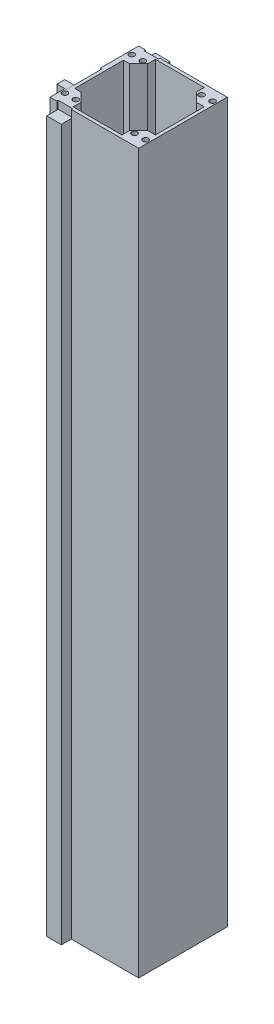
ISO-10303-21;
HEADER;
FILE_DESCRIPTION(('STEP AP214'),'2;1');
FILE_NAME('part.step','',(''),(''),'','','');
FILE_SCHEMA(('AUTOMOTIVE_DESIGN { 1 0 10303 214 1 1 1 1 }'));
ENDSEC;
DATA;
#1=APPLICATION_CONTEXT('core data for automotive mechanical design processes');
#2=APPLICATION_PROTOCOL_DEFINITION('international standard','automotive_design',2000,#1);
#3=PRODUCT_CONTEXT('',#1,'mechanical');
#4=PRODUCT('Part','Part','',(#3));
#5=PRODUCT_RELATED_PRODUCT_CATEGORY('part','',(#4));
#6=PRODUCT_DEFINITION_FORMATION('','',#4);
#7=PRODUCT_DEFINITION_CONTEXT('part definition',#1,'design');
#8=PRODUCT_DEFINITION('design','',#6,#7);
#9=PRODUCT_DEFINITION_SHAPE('','',#8);
#10=(LENGTH_UNIT() NAMED_UNIT(*) SI_UNIT(.MILLI.,.METRE.));
#11=(NAMED_UNIT(*) PLANE_ANGLE_UNIT() SI_UNIT($,.RADIAN.));
#12=(NAMED_UNIT(*) SI_UNIT($,.STERADIAN.) SOLID_ANGLE_UNIT());
#13=UNCERTAINTY_MEASURE_WITH_UNIT(LENGTH_MEASURE(1.E-05),#10,'distance_accuracy_value','');
#14=(GEOMETRIC_REPRESENTATION_CONTEXT(3) GLOBAL_UNCERTAINTY_ASSIGNED_CONTEXT((#13)) GLOBAL_UNIT_ASSIGNED_CONTEXT((#10,
#11,#12)) REPRESENTATION_CONTEXT('',''));
#15=CARTESIAN_POINT('',(0.,0.,0.));
#16=DIRECTION('',(0.,0.,1.));
#17=DIRECTION('',(1.,0.,0.));
#18=AXIS2_PLACEMENT_3D('',#15,#16,#17);
#19=CARTESIAN_POINT('',(-130.5,317.,-85.));
#20=DIRECTION('',(0.,-1.,0.));
#21=DIRECTION('',(0.,0.,-1.));
#22=AXIS2_PLACEMENT_3D('',#19,#20,#21);
#23=CYLINDRICAL_SURFACE('',#22,17.5);
#24=CARTESIAN_POINT('',(-130.5,317.,-85.));
#25=DIRECTION('',(0.,1.,0.));
#26=DIRECTION('',(0.,0.,1.));
#27=AXIS2_PLACEMENT_3D('',#24,#25,#26);
#28=CIRCLE('',#27,17.5);
#29=CARTESIAN_POINT('',(-130.5,317.,-67.5));
#30=VERTEX_POINT('',#29);
#31=EDGE_CURVE('E11',#30,#30,#28,.T.);
#32=ORIENTED_EDGE('',*,*,#31,.F.);
#33=EDGE_LOOP('',(#32));
#34=FACE_BOUND('',#33,.T.);
#35=CARTESIAN_POINT('',(-130.5,277.,-85.));
#36=DIRECTION('',(0.,1.,0.));
#37=DIRECTION('',(0.,0.,1.));
#38=AXIS2_PLACEMENT_3D('',#35,#36,#37);
#39=CIRCLE('',#38,17.5);
#40=CARTESIAN_POINT('',(-130.5,277.,-67.5));
#41=VERTEX_POINT('',#40);
#42=EDGE_CURVE('E58',#41,#41,#39,.T.);
#43=ORIENTED_EDGE('',*,*,#42,.T.);
#44=EDGE_LOOP('',(#43));
#45=FACE_BOUND('',#44,.T.);
#46=ADVANCED_FACE('F55',(#34,#45),#23,.T.);
#47=CARTESIAN_POINT('',(-130.5,317.,-85.));
#48=DIRECTION('',(0.,1.,0.));
#49=DIRECTION('',(0.,0.,1.));
#50=AXIS2_PLACEMENT_3D('',#47,#48,#49);
#51=PLANE('',#50);
#52=ORIENTED_EDGE('',*,*,#31,.T.);
#53=EDGE_LOOP('',(#52));
#54=FACE_BOUND('',#53,.T.);
#55=ADVANCED_FACE('F70',(#54),#51,.T.);
#56=CARTESIAN_POINT('',(-130.5,277.,-85.));
#57=DIRECTION('',(0.,1.,0.));
#58=DIRECTION('',(0.,0.,1.));
#59=AXIS2_PLACEMENT_3D('',#56,#57,#58);
#60=PLANE('',#59);
#61=ORIENTED_EDGE('',*,*,#42,.F.);
#62=EDGE_LOOP('',(#61));
#63=FACE_BOUND('',#62,.T.);
#64=ADVANCED_FACE('F68',(#63),#60,.F.);
#65=CLOSED_SHELL('',(#46,#55,#64));
#66=MANIFOLD_SOLID_BREP('B2_NOT_SHOWN',#65);
#67=CARTESIAN_POINT('',(-148.5,277.,-105.));
#68=DIRECTION('',(1.,0.,0.));
#69=DIRECTION('',(0.,0.,-1.));
#70=AXIS2_PLACEMENT_3D('',#67,#68,#69);
#71=PLANE('',#70);
#72=DIRECTION('',(0.,0.,1.));
#73=VECTOR('',#72,1.);
#74=CARTESIAN_POINT('',(-148.5,177.,-105.));
#75=LINE('',#74,#73);
#76=CARTESIAN_POINT('',(-148.5,177.,-105.));
#77=VERTEX_POINT('',#76);
#78=CARTESIAN_POINT('',(-148.5,177.,-65.));
#79=VERTEX_POINT('',#78);
#80=EDGE_CURVE('E168',#77,#79,#75,.T.);
#81=ORIENTED_EDGE('',*,*,#80,.T.);
#82=DIRECTION('',(0.,-1.,0.));
#83=VECTOR('',#82,1.);
#84=CARTESIAN_POINT('',(-148.5,277.,-65.));
#85=LINE('',#84,#83);
#86=CARTESIAN_POINT('',(-148.5,277.,-65.));
#87=VERTEX_POINT('',#86);
#88=EDGE_CURVE('E53',#87,#79,#85,.T.);
#89=ORIENTED_EDGE('',*,*,#88,.F.);
#90=DIRECTION('',(0.,0.,1.));
#91=VECTOR('',#90,1.);
#92=CARTESIAN_POINT('',(-148.5,277.,-105.));
#93=LINE('',#92,#91);
#94=CARTESIAN_POINT('',(-148.5,277.,-105.));
#95=VERTEX_POINT('',#94);
#96=EDGE_CURVE('E156',#95,#87,#93,.T.);
#97=ORIENTED_EDGE('',*,*,#96,.F.);
#98=DIRECTION('',(0.,-1.,0.));
#99=VECTOR('',#98,1.);
#100=CARTESIAN_POINT('',(-148.5,277.,-105.));
#101=LINE('',#100,#99);
#102=EDGE_CURVE('E164',#95,#77,#101,.T.);
#103=ORIENTED_EDGE('',*,*,#102,.T.);
#104=EDGE_LOOP('',(#81,#89,#97,#103));
#105=FACE_BOUND('',#104,.T.);
#106=ADVANCED_FACE('F105',(#105),#71,.F.);
#107=CARTESIAN_POINT('',(-148.5,277.,-65.));
#108=DIRECTION('',(0.,0.,-1.));
#109=DIRECTION('',(-1.,0.,0.));
#110=AXIS2_PLACEMENT_3D('',#107,#108,#109);
#111=PLANE('',#110);
#112=DIRECTION('',(1.,0.,0.));
#113=VECTOR('',#112,1.);
#114=CARTESIAN_POINT('',(-148.5,177.,-65.));
#115=LINE('',#114,#113);
#116=CARTESIAN_POINT('',(-112.5,177.,-65.));
#117=VERTEX_POINT('',#116);
#118=EDGE_CURVE('E160',#79,#117,#115,.T.);
#119=ORIENTED_EDGE('',*,*,#118,.T.);
#120=DIRECTION('',(0.,-1.,0.));
#121=VECTOR('',#120,1.);
#122=CARTESIAN_POINT('',(-112.5,277.,-65.));
#123=LINE('',#122,#121);
#124=CARTESIAN_POINT('',(-112.5,277.,-65.));
#125=VERTEX_POINT('',#124);
#126=EDGE_CURVE('E113',#125,#117,#123,.T.);
#127=ORIENTED_EDGE('',*,*,#126,.F.);
#128=DIRECTION('',(1.,0.,0.));
#129=VECTOR('',#128,1.);
#130=CARTESIAN_POINT('',(-148.5,277.,-65.));
#131=LINE('',#130,#129);
#132=EDGE_CURVE('E151',#87,#125,#131,.T.);
#133=ORIENTED_EDGE('',*,*,#132,.F.);
#134=ORIENTED_EDGE('',*,*,#88,.T.);
#135=EDGE_LOOP('',(#119,#127,#133,#134));
#136=FACE_BOUND('',#135,.T.);
#137=ADVANCED_FACE('F159',(#136),#111,.F.);
#138=CARTESIAN_POINT('',(-112.5,277.,-105.));
#139=DIRECTION('',(-1.,0.,0.));
#140=DIRECTION('',(0.,0.,1.));
#141=AXIS2_PLACEMENT_3D('',#138,#139,#140);
#142=PLANE('',#141);
#143=DIRECTION('',(0.,0.,-1.));
#144=VECTOR('',#143,1.);
#145=CARTESIAN_POINT('',(-112.5,177.,-105.));
#146=LINE('',#145,#144);
#147=CARTESIAN_POINT('',(-112.5,177.,-105.));
#148=VERTEX_POINT('',#147);
#149=EDGE_CURVE('E138',#117,#148,#146,.T.);
#150=ORIENTED_EDGE('',*,*,#149,.T.);
#151=DIRECTION('',(0.,-1.,0.));
#152=VECTOR('',#151,1.);
#153=CARTESIAN_POINT('',(-112.5,277.,-105.));
#154=LINE('',#153,#152);
#155=CARTESIAN_POINT('',(-112.5,277.,-105.));
#156=VERTEX_POINT('',#155);
#157=EDGE_CURVE('E161',#156,#148,#154,.T.);
#158=ORIENTED_EDGE('',*,*,#157,.F.);
#159=DIRECTION('',(0.,0.,-1.));
#160=VECTOR('',#159,1.);
#161=CARTESIAN_POINT('',(-112.5,277.,-105.));
#162=LINE('',#161,#160);
#163=EDGE_CURVE('E154',#125,#156,#162,.T.);
#164=ORIENTED_EDGE('',*,*,#163,.F.);
#165=ORIENTED_EDGE('',*,*,#126,.T.);
#166=EDGE_LOOP('',(#150,#158,#164,#165));
#167=FACE_BOUND('',#166,.T.);
#168=ADVANCED_FACE('F162',(#167),#142,.F.);
#169=CARTESIAN_POINT('',(-148.5,277.,-105.));
#170=DIRECTION('',(0.,0.,1.));
#171=DIRECTION('',(1.,0.,0.));
#172=AXIS2_PLACEMENT_3D('',#169,#170,#171);
#173=PLANE('',#172);
#174=DIRECTION('',(-1.,0.,0.));
#175=VECTOR('',#174,1.);
#176=CARTESIAN_POINT('',(-148.5,177.,-105.));
#177=LINE('',#176,#175);
#178=EDGE_CURVE('E144',#148,#77,#177,.T.);
#179=ORIENTED_EDGE('',*,*,#178,.T.);
#180=ORIENTED_EDGE('',*,*,#102,.F.);
#181=DIRECTION('',(-1.,0.,0.));
#182=VECTOR('',#181,1.);
#183=CARTESIAN_POINT('',(-148.5,277.,-105.));
#184=LINE('',#183,#182);
#185=EDGE_CURVE('E121',#156,#95,#184,.T.);
#186=ORIENTED_EDGE('',*,*,#185,.F.);
#187=ORIENTED_EDGE('',*,*,#157,.T.);
#188=EDGE_LOOP('',(#179,#180,#186,#187));
#189=FACE_BOUND('',#188,.T.);
#190=ADVANCED_FACE('F175',(#189),#173,.F.);
#191=CARTESIAN_POINT('',(-148.5,277.,-65.));
#192=DIRECTION('',(0.,1.,0.));
#193=DIRECTION('',(0.,0.,1.));
#194=AXIS2_PLACEMENT_3D('',#191,#192,#193);
#195=PLANE('',#194);
#196=ORIENTED_EDGE('',*,*,#96,.T.);
#197=ORIENTED_EDGE('',*,*,#132,.T.);
#198=ORIENTED_EDGE('',*,*,#163,.T.);
#199=ORIENTED_EDGE('',*,*,#185,.T.);
#200=EDGE_LOOP('',(#196,#197,#198,#199));
#201=FACE_BOUND('',#200,.T.);
#202=ADVANCED_FACE('F152',(#201),#195,.T.);
#203=CARTESIAN_POINT('',(-148.5,177.,-65.));
#204=DIRECTION('',(0.,1.,0.));
#205=DIRECTION('',(0.,0.,1.));
#206=AXIS2_PLACEMENT_3D('',#203,#204,#205);
#207=PLANE('',#206);
#208=ORIENTED_EDGE('',*,*,#80,.F.);
#209=ORIENTED_EDGE('',*,*,#178,.F.);
#210=ORIENTED_EDGE('',*,*,#149,.F.);
#211=ORIENTED_EDGE('',*,*,#118,.F.);
#212=EDGE_LOOP('',(#208,#209,#210,#211));
#213=FACE_BOUND('',#212,.T.);
#214=ADVANCED_FACE('F178',(#213),#207,.F.);
#215=CLOSED_SHELL('',(#106,#137,#168,#190,#202,#214));
#216=MANIFOLD_SOLID_BREP('B6_NOT_SHOWN',#215);
#217=CARTESIAN_POINT('',(-132.5,1855.92329219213,75.));
#218=DIRECTION('',(1.,0.,0.));
#219=DIRECTION('',(0.,0.,-1.));
#220=AXIS2_PLACEMENT_3D('',#217,#218,#219);
#221=PLANE('',#220);
#222=DIRECTION('',(0.,0.,1.));
#223=VECTOR('',#222,1.);
#224=CARTESIAN_POINT('',(-132.5,1825.,75.));
#225=LINE('',#224,#223);
#226=CARTESIAN_POINT('',(-132.5,1825.,55.5));
#227=VERTEX_POINT('',#226);
#228=CARTESIAN_POINT('',(-132.5,1825.,75.));
#229=VERTEX_POINT('',#228);
#230=EDGE_CURVE('E288',#227,#229,#225,.T.);
#231=ORIENTED_EDGE('',*,*,#230,.F.);
#232=DIRECTION('',(0.,-1.,0.));
#233=VECTOR('',#232,1.);
#234=CARTESIAN_POINT('',(-132.5,1855.92329219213,55.5));
#235=LINE('',#234,#233);
#236=CARTESIAN_POINT('',(-132.5,120.,55.5));
#237=VERTEX_POINT('',#236);
#238=EDGE_CURVE('E242',#227,#237,#235,.T.);
#239=ORIENTED_EDGE('',*,*,#238,.T.);
#240=DIRECTION('',(0.,0.,1.));
#241=VECTOR('',#240,1.);
#242=CARTESIAN_POINT('',(-132.5,120.,75.));
#243=LINE('',#242,#241);
#244=CARTESIAN_POINT('',(-132.5,120.,75.));
#245=VERTEX_POINT('',#244);
#246=EDGE_CURVE('E286',#237,#245,#243,.T.);
#247=ORIENTED_EDGE('',*,*,#246,.T.);
#248=DIRECTION('',(0.,-1.,0.));
#249=VECTOR('',#248,1.);
#250=CARTESIAN_POINT('',(-132.5,1855.92329219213,75.));
#251=LINE('',#250,#249);
#252=EDGE_CURVE('E277',#229,#245,#251,.T.);
#253=ORIENTED_EDGE('',*,*,#252,.F.);
#254=EDGE_LOOP('',(#231,#239,#247,#253));
#255=FACE_BOUND('',#254,.T.);
#256=ADVANCED_FACE('F238',(#255),#221,.F.);
#257=CARTESIAN_POINT('',(-132.5,1855.92329219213,75.));
#258=DIRECTION('',(0.,0.,-1.));
#259=DIRECTION('',(-1.,0.,0.));
#260=AXIS2_PLACEMENT_3D('',#257,#258,#259);
#261=PLANE('',#260);
#262=DIRECTION('',(1.,0.,0.));
#263=VECTOR('',#262,1.);
#264=CARTESIAN_POINT('',(-132.5,1825.,75.));
#265=LINE('',#264,#263);
#266=CARTESIAN_POINT('',(-108.5,1825.,75.));
#267=VERTEX_POINT('',#266);
#268=EDGE_CURVE('E247',#229,#267,#265,.T.);
#269=ORIENTED_EDGE('',*,*,#268,.F.);
#270=ORIENTED_EDGE('',*,*,#252,.T.);
#271=DIRECTION('',(1.,0.,0.));
#272=VECTOR('',#271,1.);
#273=CARTESIAN_POINT('',(-132.5,120.,75.));
#274=LINE('',#273,#272);
#275=CARTESIAN_POINT('',(-108.5,120.,75.));
#276=VERTEX_POINT('',#275);
#277=EDGE_CURVE('E299',#245,#276,#274,.T.);
#278=ORIENTED_EDGE('',*,*,#277,.T.);
#279=DIRECTION('',(0.,-1.,0.));
#280=VECTOR('',#279,1.);
#281=CARTESIAN_POINT('',(-108.5,1855.92329219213,75.));
#282=LINE('',#281,#280);
#283=EDGE_CURVE('E309',#267,#276,#282,.T.);
#284=ORIENTED_EDGE('',*,*,#283,.F.);
#285=EDGE_LOOP('',(#269,#270,#278,#284));
#286=FACE_BOUND('',#285,.T.);
#287=ADVANCED_FACE('F315',(#286),#261,.F.);
#288=CARTESIAN_POINT('',(-108.5,1855.92329219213,75.));
#289=DIRECTION('',(-1.,0.,0.));
#290=DIRECTION('',(0.,0.,1.));
#291=AXIS2_PLACEMENT_3D('',#288,#289,#290);
#292=PLANE('',#291);
#293=DIRECTION('',(0.,0.,-1.));
#294=VECTOR('',#293,1.);
#295=CARTESIAN_POINT('',(-108.5,1825.,75.));
#296=LINE('',#295,#294);
#297=CARTESIAN_POINT('',(-108.5,1825.,55.5));
#298=VERTEX_POINT('',#297);
#299=EDGE_CURVE('E103',#267,#298,#296,.T.);
#300=ORIENTED_EDGE('',*,*,#299,.F.);
#301=ORIENTED_EDGE('',*,*,#283,.T.);
#302=DIRECTION('',(0.,0.,-1.));
#303=VECTOR('',#302,1.);
#304=CARTESIAN_POINT('',(-108.5,120.,75.));
#305=LINE('',#304,#303);
#306=CARTESIAN_POINT('',(-108.5,120.,55.5));
#307=VERTEX_POINT('',#306);
#308=EDGE_CURVE('E311',#276,#307,#305,.T.);
#309=ORIENTED_EDGE('',*,*,#308,.T.);
#310=DIRECTION('',(0.,-1.,0.));
#311=VECTOR('',#310,1.);
#312=CARTESIAN_POINT('',(-108.5,1855.92329219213,55.5));
#313=LINE('',#312,#311);
#314=EDGE_CURVE('E260',#298,#307,#313,.T.);
#315=ORIENTED_EDGE('',*,*,#314,.F.);
#316=EDGE_LOOP('',(#300,#301,#309,#315));
#317=FACE_BOUND('',#316,.T.);
#318=ADVANCED_FACE('F314',(#317),#292,.F.);
#319=CARTESIAN_POINT('',(-132.5,1855.92329219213,55.5));
#320=DIRECTION('',(0.,0.,1.));
#321=DIRECTION('',(1.,0.,0.));
#322=AXIS2_PLACEMENT_3D('',#319,#320,#321);
#323=PLANE('',#322);
#324=DIRECTION('',(-1.,0.,0.));
#325=VECTOR('',#324,1.);
#326=CARTESIAN_POINT('',(-132.5,1825.,55.5));
#327=LINE('',#326,#325);
#328=EDGE_CURVE('E296',#298,#227,#327,.T.);
#329=ORIENTED_EDGE('',*,*,#328,.F.);
#330=ORIENTED_EDGE('',*,*,#314,.T.);
#331=DIRECTION('',(-1.,0.,0.));
#332=VECTOR('',#331,1.);
#333=CARTESIAN_POINT('',(-132.5,120.,55.5));
#334=LINE('',#333,#332);
#335=EDGE_CURVE('E292',#307,#237,#334,.T.);
#336=ORIENTED_EDGE('',*,*,#335,.T.);
#337=ORIENTED_EDGE('',*,*,#238,.F.);
#338=EDGE_LOOP('',(#329,#330,#336,#337));
#339=FACE_BOUND('',#338,.T.);
#340=ADVANCED_FACE('F293',(#339),#323,.F.);
#341=CARTESIAN_POINT('',(-132.5,120.,55.5));
#342=DIRECTION('',(0.,-1.,0.));
#343=DIRECTION('',(0.,0.,-1.));
#344=AXIS2_PLACEMENT_3D('',#341,#342,#343);
#345=PLANE('',#344);
#346=ORIENTED_EDGE('',*,*,#246,.F.);
#347=ORIENTED_EDGE('',*,*,#335,.F.);
#348=ORIENTED_EDGE('',*,*,#308,.F.);
#349=ORIENTED_EDGE('',*,*,#277,.F.);
#350=EDGE_LOOP('',(#346,#347,#348,#349));
#351=FACE_BOUND('',#350,.T.);
#352=ADVANCED_FACE('F298',(#351),#345,.T.);
#353=CARTESIAN_POINT('',(112.5,1825.,112.5));
#354=DIRECTION('',(0.,1.,0.));
#355=DIRECTION('',(0.,0.,1.));
#356=AXIS2_PLACEMENT_3D('',#353,#354,#355);
#357=PLANE('',#356);
#358=ORIENTED_EDGE('',*,*,#328,.T.);
#359=ORIENTED_EDGE('',*,*,#230,.T.);
#360=ORIENTED_EDGE('',*,*,#268,.T.);
#361=ORIENTED_EDGE('',*,*,#299,.T.);
#362=EDGE_LOOP('',(#358,#359,#360,#361));
#363=FACE_BOUND('',#362,.T.);
#364=ADVANCED_FACE('F240',(#363),#357,.T.);
#365=CLOSED_SHELL('',(#256,#287,#318,#340,#352,#364));
#366=MANIFOLD_SOLID_BREP('B47',#365);
#367=CARTESIAN_POINT('',(-58.5,1872.01063709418,138.000000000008));
#368=DIRECTION('',(-1.,0.,0.));
#369=DIRECTION('',(0.,0.,1.));
#370=AXIS2_PLACEMENT_3D('',#367,#368,#369);
#371=PLANE('',#370);
#372=DIRECTION('',(0.,0.,-1.));
#373=VECTOR('',#372,1.);
#374=CARTESIAN_POINT('',(-58.5,1805.,138.000000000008));
#375=LINE('',#374,#373);
#376=CARTESIAN_POINT('',(-58.5,1805.,138.000000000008));
#377=VERTEX_POINT('',#376);
#378=CARTESIAN_POINT('',(-58.5,1805.,109.));
#379=VERTEX_POINT('',#378);
#380=EDGE_CURVE('E426',#377,#379,#375,.T.);
#381=ORIENTED_EDGE('',*,*,#380,.F.);
#382=DIRECTION('',(0.,-1.,0.));
#383=VECTOR('',#382,1.);
#384=CARTESIAN_POINT('',(-58.5,1872.01063709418,138.000000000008));
#385=LINE('',#384,#383);
#386=CARTESIAN_POINT('',(-58.5,0.,138.000000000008));
#387=VERTEX_POINT('',#386);
#388=EDGE_CURVE('E378',#377,#387,#385,.T.);
#389=ORIENTED_EDGE('',*,*,#388,.T.);
#390=DIRECTION('',(0.,0.,-1.));
#391=VECTOR('',#390,1.);
#392=CARTESIAN_POINT('',(-58.5,0.,138.000000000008));
#393=LINE('',#392,#391);
#394=CARTESIAN_POINT('',(-58.5,0.,109.));
#395=VERTEX_POINT('',#394);
#396=EDGE_CURVE('E433',#387,#395,#393,.T.);
#397=ORIENTED_EDGE('',*,*,#396,.T.);
#398=DIRECTION('',(0.,-1.,0.));
#399=VECTOR('',#398,1.);
#400=CARTESIAN_POINT('',(-58.5,1872.01063709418,109.));
#401=LINE('',#400,#399);
#402=EDGE_CURVE('E410',#379,#395,#401,.T.);
#403=ORIENTED_EDGE('',*,*,#402,.F.);
#404=EDGE_LOOP('',(#381,#389,#397,#403));
#405=FACE_BOUND('',#404,.T.);
#406=ADVANCED_FACE('F375',(#405),#371,.F.);
#407=CARTESIAN_POINT('',(-58.5,1872.01063709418,109.));
#408=DIRECTION('',(0.,0.,1.));
#409=DIRECTION('',(1.,0.,0.));
#410=AXIS2_PLACEMENT_3D('',#407,#408,#409);
#411=PLANE('',#410);
#412=DIRECTION('',(-1.,0.,0.));
#413=VECTOR('',#412,1.);
#414=CARTESIAN_POINT('',(-58.5,1805.,109.));
#415=LINE('',#414,#413);
#416=CARTESIAN_POINT('',(-95.5,1805.,109.));
#417=VERTEX_POINT('',#416);
#418=EDGE_CURVE('E420',#379,#417,#415,.T.);
#419=ORIENTED_EDGE('',*,*,#418,.F.);
#420=ORIENTED_EDGE('',*,*,#402,.T.);
#421=DIRECTION('',(-1.,0.,0.));
#422=VECTOR('',#421,1.);
#423=CARTESIAN_POINT('',(-58.5,0.,109.));
#424=LINE('',#423,#422);
#425=CARTESIAN_POINT('',(-95.5,0.,109.));
#426=VERTEX_POINT('',#425);
#427=EDGE_CURVE('E441',#395,#426,#424,.T.);
#428=ORIENTED_EDGE('',*,*,#427,.T.);
#429=DIRECTION('',(0.,-1.,0.));
#430=VECTOR('',#429,1.);
#431=CARTESIAN_POINT('',(-95.5,1872.01063709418,109.));
#432=LINE('',#431,#430);
#433=EDGE_CURVE('E440',#417,#426,#432,.T.);
#434=ORIENTED_EDGE('',*,*,#433,.F.);
#435=EDGE_LOOP('',(#419,#420,#428,#434));
#436=FACE_BOUND('',#435,.T.);
#437=ADVANCED_FACE('F450',(#436),#411,.F.);
#438=CARTESIAN_POINT('',(-95.5,1872.01063709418,138.000000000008));
#439=DIRECTION('',(1.,0.,0.));
#440=DIRECTION('',(0.,0.,-1.));
#441=AXIS2_PLACEMENT_3D('',#438,#439,#440);
#442=PLANE('',#441);
#443=DIRECTION('',(0.,0.,1.));
#444=VECTOR('',#443,1.);
#445=CARTESIAN_POINT('',(-95.5,1805.,109.));
#446=LINE('',#445,#444);
#447=CARTESIAN_POINT('',(-95.5,1805.,138.000000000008));
#448=VERTEX_POINT('',#447);
#449=EDGE_CURVE('E391',#417,#448,#446,.T.);
#450=ORIENTED_EDGE('',*,*,#449,.F.);
#451=ORIENTED_EDGE('',*,*,#433,.T.);
#452=DIRECTION('',(0.,0.,1.));
#453=VECTOR('',#452,1.);
#454=CARTESIAN_POINT('',(-95.5,0.,138.000000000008));
#455=LINE('',#454,#453);
#456=CARTESIAN_POINT('',(-95.5,0.,138.000000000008));
#457=VERTEX_POINT('',#456);
#458=EDGE_CURVE('E438',#426,#457,#455,.T.);
#459=ORIENTED_EDGE('',*,*,#458,.T.);
#460=DIRECTION('',(0.,-1.,0.));
#461=VECTOR('',#460,1.);
#462=CARTESIAN_POINT('',(-95.5,1872.01063709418,138.000000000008));
#463=LINE('',#462,#461);
#464=EDGE_CURVE('E383',#448,#457,#463,.T.);
#465=ORIENTED_EDGE('',*,*,#464,.F.);
#466=EDGE_LOOP('',(#450,#451,#459,#465));
#467=FACE_BOUND('',#466,.T.);
#468=ADVANCED_FACE('F448',(#467),#442,.F.);
#469=CARTESIAN_POINT('',(-58.5,1872.01063709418,138.000000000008));
#470=DIRECTION('',(0.,0.,-1.));
#471=DIRECTION('',(-1.,0.,0.));
#472=AXIS2_PLACEMENT_3D('',#469,#470,#471);
#473=PLANE('',#472);
#474=DIRECTION('',(1.,0.,0.));
#475=VECTOR('',#474,1.);
#476=CARTESIAN_POINT('',(-95.5,1805.,138.000000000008));
#477=LINE('',#476,#475);
#478=EDGE_CURVE('E424',#448,#377,#477,.T.);
#479=ORIENTED_EDGE('',*,*,#478,.F.);
#480=ORIENTED_EDGE('',*,*,#464,.T.);
#481=DIRECTION('',(1.,0.,0.));
#482=VECTOR('',#481,1.);
#483=CARTESIAN_POINT('',(-58.5,0.,138.000000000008));
#484=LINE('',#483,#482);
#485=EDGE_CURVE('E236',#457,#387,#484,.T.);
#486=ORIENTED_EDGE('',*,*,#485,.T.);
#487=ORIENTED_EDGE('',*,*,#388,.F.);
#488=EDGE_LOOP('',(#479,#480,#486,#487));
#489=FACE_BOUND('',#488,.T.);
#490=ADVANCED_FACE('F429',(#489),#473,.F.);
#491=CARTESIAN_POINT('',(-58.5,0.,109.));
#492=DIRECTION('',(0.,1.,0.));
#493=DIRECTION('',(0.,0.,1.));
#494=AXIS2_PLACEMENT_3D('',#491,#492,#493);
#495=PLANE('',#494);
#496=ORIENTED_EDGE('',*,*,#396,.F.);
#497=ORIENTED_EDGE('',*,*,#485,.F.);
#498=ORIENTED_EDGE('',*,*,#458,.F.);
#499=ORIENTED_EDGE('',*,*,#427,.F.);
#500=EDGE_LOOP('',(#496,#497,#498,#499));
#501=FACE_BOUND('',#500,.T.);
#502=ADVANCED_FACE('F452',(#501),#495,.F.);
#503=CARTESIAN_POINT('',(0.,1805.,0.));
#504=DIRECTION('',(0.,1.,0.));
#505=DIRECTION('',(0.,0.,1.));
#506=AXIS2_PLACEMENT_3D('',#503,#504,#505);
#507=PLANE('',#506);
#508=ORIENTED_EDGE('',*,*,#449,.T.);
#509=ORIENTED_EDGE('',*,*,#478,.T.);
#510=ORIENTED_EDGE('',*,*,#380,.T.);
#511=ORIENTED_EDGE('',*,*,#418,.T.);
#512=EDGE_LOOP('',(#508,#509,#510,#511));
#513=FACE_BOUND('',#512,.T.);
#514=ADVANCED_FACE('F425',(#513),#507,.T.);
#515=CLOSED_SHELL('',(#406,#437,#468,#490,#502,#514));
#516=MANIFOLD_SOLID_BREP('B97',#515);
#517=CARTESIAN_POINT('',(-95.5,1872.01063709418,-138.000000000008));
#518=DIRECTION('',(1.,0.,0.));
#519=DIRECTION('',(0.,0.,-1.));
#520=AXIS2_PLACEMENT_3D('',#517,#518,#519);
#521=PLANE('',#520);
#522=DIRECTION('',(0.,0.,1.));
#523=VECTOR('',#522,1.);
#524=CARTESIAN_POINT('',(-95.5,1805.,-138.000000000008));
#525=LINE('',#524,#523);
#526=CARTESIAN_POINT('',(-95.5,1805.,-138.000000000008));
#527=VERTEX_POINT('',#526);
#528=CARTESIAN_POINT('',(-95.5,1805.,-109.));
#529=VERTEX_POINT('',#528);
#530=EDGE_CURVE('E563',#527,#529,#525,.T.);
#531=ORIENTED_EDGE('',*,*,#530,.F.);
#532=DIRECTION('',(0.,-1.,0.));
#533=VECTOR('',#532,1.);
#534=CARTESIAN_POINT('',(-95.5,1872.01063709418,-138.000000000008));
#535=LINE('',#534,#533);
#536=CARTESIAN_POINT('',(-95.5,0.,-138.000000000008));
#537=VERTEX_POINT('',#536);
#538=EDGE_CURVE('E514',#527,#537,#535,.T.);
#539=ORIENTED_EDGE('',*,*,#538,.T.);
#540=DIRECTION('',(0.,0.,1.));
#541=VECTOR('',#540,1.);
#542=CARTESIAN_POINT('',(-95.5,0.,-138.000000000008));
#543=LINE('',#542,#541);
#544=CARTESIAN_POINT('',(-95.5,0.,-109.));
#545=VERTEX_POINT('',#544);
#546=EDGE_CURVE('E571',#537,#545,#543,.T.);
#547=ORIENTED_EDGE('',*,*,#546,.T.);
#548=DIRECTION('',(0.,-1.,0.));
#549=VECTOR('',#548,1.);
#550=CARTESIAN_POINT('',(-95.5,1872.01063709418,-109.));
#551=LINE('',#550,#549);
#552=EDGE_CURVE('E546',#529,#545,#551,.T.);
#553=ORIENTED_EDGE('',*,*,#552,.F.);
#554=EDGE_LOOP('',(#531,#539,#547,#553));
#555=FACE_BOUND('',#554,.T.);
#556=ADVANCED_FACE('F511',(#555),#521,.F.);
#557=CARTESIAN_POINT('',(-95.5,1872.01063709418,-109.));
#558=DIRECTION('',(0.,0.,-1.));
#559=DIRECTION('',(-1.,0.,0.));
#560=AXIS2_PLACEMENT_3D('',#557,#558,#559);
#561=PLANE('',#560);
#562=DIRECTION('',(1.,0.,0.));
#563=VECTOR('',#562,1.);
#564=CARTESIAN_POINT('',(-95.5,1805.,-109.));
#565=LINE('',#564,#563);
#566=CARTESIAN_POINT('',(-58.5,1805.,-109.));
#567=VERTEX_POINT('',#566);
#568=EDGE_CURVE('E556',#529,#567,#565,.T.);
#569=ORIENTED_EDGE('',*,*,#568,.F.);
#570=ORIENTED_EDGE('',*,*,#552,.T.);
#571=DIRECTION('',(1.,0.,0.));
#572=VECTOR('',#571,1.);
#573=CARTESIAN_POINT('',(-95.5,0.,-109.));
#574=LINE('',#573,#572);
#575=CARTESIAN_POINT('',(-58.5,0.,-109.));
#576=VERTEX_POINT('',#575);
#577=EDGE_CURVE('E579',#545,#576,#574,.T.);
#578=ORIENTED_EDGE('',*,*,#577,.T.);
#579=DIRECTION('',(0.,-1.,0.));
#580=VECTOR('',#579,1.);
#581=CARTESIAN_POINT('',(-58.5,1872.01063709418,-109.));
#582=LINE('',#581,#580);
#583=EDGE_CURVE('E578',#567,#576,#582,.T.);
#584=ORIENTED_EDGE('',*,*,#583,.F.);
#585=EDGE_LOOP('',(#569,#570,#578,#584));
#586=FACE_BOUND('',#585,.T.);
#587=ADVANCED_FACE('F588',(#586),#561,.F.);
#588=CARTESIAN_POINT('',(-58.5,1872.01063709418,-138.000000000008));
#589=DIRECTION('',(-1.,0.,0.));
#590=DIRECTION('',(0.,0.,1.));
#591=AXIS2_PLACEMENT_3D('',#588,#589,#590);
#592=PLANE('',#591);
#593=DIRECTION('',(0.,0.,-1.));
#594=VECTOR('',#593,1.);
#595=CARTESIAN_POINT('',(-58.5,1805.,-109.));
#596=LINE('',#595,#594);
#597=CARTESIAN_POINT('',(-58.5,1805.,-138.000000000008));
#598=VERTEX_POINT('',#597);
#599=EDGE_CURVE('E527',#567,#598,#596,.T.);
#600=ORIENTED_EDGE('',*,*,#599,.F.);
#601=ORIENTED_EDGE('',*,*,#583,.T.);
#602=DIRECTION('',(0.,0.,-1.));
#603=VECTOR('',#602,1.);
#604=CARTESIAN_POINT('',(-58.5,0.,-138.000000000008));
#605=LINE('',#604,#603);
#606=CARTESIAN_POINT('',(-58.5,0.,-138.000000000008));
#607=VERTEX_POINT('',#606);
#608=EDGE_CURVE('E576',#576,#607,#605,.T.);
#609=ORIENTED_EDGE('',*,*,#608,.T.);
#610=DIRECTION('',(0.,-1.,0.));
#611=VECTOR('',#610,1.);
#612=CARTESIAN_POINT('',(-58.5,1872.01063709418,-138.000000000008));
#613=LINE('',#612,#611);
#614=EDGE_CURVE('E519',#598,#607,#613,.T.);
#615=ORIENTED_EDGE('',*,*,#614,.F.);
#616=EDGE_LOOP('',(#600,#601,#609,#615));
#617=FACE_BOUND('',#616,.T.);
#618=ADVANCED_FACE('F586',(#617),#592,.F.);
#619=CARTESIAN_POINT('',(-95.5,1872.01063709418,-138.000000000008));
#620=DIRECTION('',(0.,0.,1.));
#621=DIRECTION('',(1.,0.,0.));
#622=AXIS2_PLACEMENT_3D('',#619,#620,#621);
#623=PLANE('',#622);
#624=DIRECTION('',(-1.,0.,0.));
#625=VECTOR('',#624,1.);
#626=CARTESIAN_POINT('',(-58.5,1805.,-138.000000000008));
#627=LINE('',#626,#625);
#628=EDGE_CURVE('E561',#598,#527,#627,.T.);
#629=ORIENTED_EDGE('',*,*,#628,.F.);
#630=ORIENTED_EDGE('',*,*,#614,.T.);
#631=DIRECTION('',(-1.,0.,0.));
#632=VECTOR('',#631,1.);
#633=CARTESIAN_POINT('',(-95.5,0.,-138.000000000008));
#634=LINE('',#633,#632);
#635=EDGE_CURVE('E373',#607,#537,#634,.T.);
#636=ORIENTED_EDGE('',*,*,#635,.T.);
#637=ORIENTED_EDGE('',*,*,#538,.F.);
#638=EDGE_LOOP('',(#629,#630,#636,#637));
#639=FACE_BOUND('',#638,.T.);
#640=ADVANCED_FACE('F567',(#639),#623,.F.);
#641=CARTESIAN_POINT('',(-95.5,0.,-109.));
#642=DIRECTION('',(0.,1.,0.));
#643=DIRECTION('',(0.,0.,1.));
#644=AXIS2_PLACEMENT_3D('',#641,#642,#643);
#645=PLANE('',#644);
#646=ORIENTED_EDGE('',*,*,#546,.F.);
#647=ORIENTED_EDGE('',*,*,#635,.F.);
#648=ORIENTED_EDGE('',*,*,#608,.F.);
#649=ORIENTED_EDGE('',*,*,#577,.F.);
#650=EDGE_LOOP('',(#646,#647,#648,#649));
#651=FACE_BOUND('',#650,.T.);
#652=ADVANCED_FACE('F590',(#651),#645,.F.);
#653=CARTESIAN_POINT('',(0.,1805.,0.));
#654=DIRECTION('',(0.,1.,0.));
#655=DIRECTION('',(0.,0.,1.));
#656=AXIS2_PLACEMENT_3D('',#653,#654,#655);
#657=PLANE('',#656);
#658=ORIENTED_EDGE('',*,*,#599,.T.);
#659=ORIENTED_EDGE('',*,*,#628,.T.);
#660=ORIENTED_EDGE('',*,*,#530,.T.);
#661=ORIENTED_EDGE('',*,*,#568,.T.);
#662=EDGE_LOOP('',(#658,#659,#660,#661));
#663=FACE_BOUND('',#662,.T.);
#664=ADVANCED_FACE('F562',(#663),#657,.T.);
#665=CLOSED_SHELL('',(#556,#587,#618,#640,#652,#664));
#666=MANIFOLD_SOLID_BREP('B230',#665);
#667=CARTESIAN_POINT('',(-112.5,1825.,-112.5));
#668=DIRECTION('',(1.,0.,0.));
#669=DIRECTION('',(0.,0.,-1.));
#670=AXIS2_PLACEMENT_3D('',#667,#668,#669);
#671=PLANE('',#670);
#672=DIRECTION('',(0.,-1.,0.));
#673=VECTOR('',#672,1.);
#674=CARTESIAN_POINT('',(-112.5,117.5,-90.));
#675=LINE('',#674,#673);
#676=CARTESIAN_POINT('',(-112.5,257.5,-90.));
#677=VERTEX_POINT('',#676);
#678=CARTESIAN_POINT('',(-112.5,117.5,-90.));
#679=VERTEX_POINT('',#678);
#680=EDGE_CURVE('E1010',#677,#679,#675,.T.);
#681=ORIENTED_EDGE('',*,*,#680,.F.);
#682=DIRECTION('',(0.,0.,-1.));
#683=VECTOR('',#682,1.);
#684=CARTESIAN_POINT('',(-112.5,257.5,-90.));
#685=LINE('',#684,#683);
#686=CARTESIAN_POINT('',(-112.5,257.5,-50.));
#687=VERTEX_POINT('',#686);
#688=EDGE_CURVE('E1015',#687,#677,#685,.T.);
#689=ORIENTED_EDGE('',*,*,#688,.F.);
#690=DIRECTION('',(0.,1.,0.));
#691=VECTOR('',#690,1.);
#692=CARTESIAN_POINT('',(-112.5,117.5,-50.));
#693=LINE('',#692,#691);
#694=CARTESIAN_POINT('',(-112.5,117.5,-50.));
#695=VERTEX_POINT('',#694);
#696=EDGE_CURVE('E1027',#695,#687,#693,.T.);
#697=ORIENTED_EDGE('',*,*,#696,.F.);
#698=DIRECTION('',(0.,0.,1.));
#699=VECTOR('',#698,1.);
#700=CARTESIAN_POINT('',(-112.5,117.5,-90.));
#701=LINE('',#700,#699);
#702=EDGE_CURVE('E1024',#679,#695,#701,.T.);
#703=ORIENTED_EDGE('',*,*,#702,.F.);
#704=EDGE_LOOP('',(#681,#689,#697,#703));
#705=FACE_BOUND('',#704,.T.);
#706=DIRECTION('',(0.,0.,1.));
#707=VECTOR('',#706,1.);
#708=CARTESIAN_POINT('',(-112.5,0.,-112.5));
#709=LINE('',#708,#707);
#710=CARTESIAN_POINT('',(-112.5,0.,-112.5));
#711=VERTEX_POINT('',#710);
#712=CARTESIAN_POINT('',(-112.5,0.,-15.));
#713=VERTEX_POINT('',#712);
#714=EDGE_CURVE('E1206',#711,#713,#709,.T.);
#715=ORIENTED_EDGE('',*,*,#714,.T.);
#716=DIRECTION('',(0.,-1.,0.));
#717=VECTOR('',#716,1.);
#718=CARTESIAN_POINT('',(-112.5,1825.,-15.));
#719=LINE('',#718,#717);
#720=CARTESIAN_POINT('',(-112.5,1825.,-15.));
#721=VERTEX_POINT('',#720);
#722=EDGE_CURVE('E1251',#721,#713,#719,.T.);
#723=ORIENTED_EDGE('',*,*,#722,.F.);
#724=DIRECTION('',(0.,0.,1.));
#725=VECTOR('',#724,1.);
#726=CARTESIAN_POINT('',(-112.5,1825.,-112.5));
#727=LINE('',#726,#725);
#728=CARTESIAN_POINT('',(-112.5,1825.,-112.5));
#729=VERTEX_POINT('',#728);
#730=EDGE_CURVE('E1173',#729,#721,#727,.T.);
#731=ORIENTED_EDGE('',*,*,#730,.F.);
#732=DIRECTION('',(0.,-1.,0.));
#733=VECTOR('',#732,1.);
#734=CARTESIAN_POINT('',(-112.5,1825.,-112.5));
#735=LINE('',#734,#733);
#736=EDGE_CURVE('E1254',#729,#711,#735,.T.);
#737=ORIENTED_EDGE('',*,*,#736,.T.);
#738=EDGE_LOOP('',(#715,#723,#731,#737));
#739=FACE_BOUND('',#738,.T.);
#740=DIRECTION('',(0.,-1.,0.));
#741=VECTOR('',#740,1.);
#742=CARTESIAN_POINT('',(-112.5,1675.5,-89.9999999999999));
#743=LINE('',#742,#741);
#744=CARTESIAN_POINT('',(-112.5,1675.5,-89.9999999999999));
#745=VERTEX_POINT('',#744);
#746=CARTESIAN_POINT('',(-112.5,1535.5,-89.9999999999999));
#747=VERTEX_POINT('',#746);
#748=EDGE_CURVE('E982',#745,#747,#743,.T.);
#749=ORIENTED_EDGE('',*,*,#748,.F.);
#750=DIRECTION('',(0.,0.,-1.));
#751=VECTOR('',#750,1.);
#752=CARTESIAN_POINT('',(-112.5,1675.5,-89.9999999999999));
#753=LINE('',#752,#751);
#754=CARTESIAN_POINT('',(-112.5,1675.5,-49.9999999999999));
#755=VERTEX_POINT('',#754);
#756=EDGE_CURVE('E987',#755,#745,#753,.T.);
#757=ORIENTED_EDGE('',*,*,#756,.F.);
#758=DIRECTION('',(0.,1.,0.));
#759=VECTOR('',#758,1.);
#760=CARTESIAN_POINT('',(-112.5,1675.5,-49.9999999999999));
#761=LINE('',#760,#759);
#762=CARTESIAN_POINT('',(-112.5,1535.5,-49.9999999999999));
#763=VERTEX_POINT('',#762);
#764=EDGE_CURVE('E662',#763,#755,#761,.T.);
#765=ORIENTED_EDGE('',*,*,#764,.F.);
#766=DIRECTION('',(0.,0.,1.));
#767=VECTOR('',#766,1.);
#768=CARTESIAN_POINT('',(-112.5,1535.5,-89.9999999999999));
#769=LINE('',#768,#767);
#770=EDGE_CURVE('E657',#747,#763,#769,.T.);
#771=ORIENTED_EDGE('',*,*,#770,.F.);
#772=EDGE_LOOP('',(#749,#757,#765,#771));
#773=FACE_BOUND('',#772,.T.);
#774=ADVANCED_FACE('F642',(#705,#739,#773),#671,.F.);
#775=CARTESIAN_POINT('',(112.5,1825.,112.5));
#776=DIRECTION('',(0.,1.,0.));
#777=DIRECTION('',(0.,0.,1.));
#778=AXIS2_PLACEMENT_3D('',#775,#776,#777);
#779=PLANE('',#778);
#780=CARTESIAN_POINT('',(-102.5,1825.,-85.));
#781=DIRECTION('',(0.,1.,0.));
#782=DIRECTION('',(0.,0.,1.));
#783=AXIS2_PLACEMENT_3D('',#780,#781,#782);
#784=CIRCLE('',#783,6.99999999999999);
#785=CARTESIAN_POINT('',(-102.5,1825.,-78.));
#786=VERTEX_POINT('',#785);
#787=EDGE_CURVE('E930',#786,#786,#784,.T.);
#788=ORIENTED_EDGE('',*,*,#787,.F.);
#789=EDGE_LOOP('',(#788));
#790=FACE_BOUND('',#789,.T.);
#791=CARTESIAN_POINT('',(-74.5,1825.,-85.));
#792=DIRECTION('',(0.,1.,0.));
#793=DIRECTION('',(0.,0.,1.));
#794=AXIS2_PLACEMENT_3D('',#791,#792,#793);
#795=CIRCLE('',#794,6.99999999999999);
#796=CARTESIAN_POINT('',(-74.5,1825.,-78.));
#797=VERTEX_POINT('',#796);
#798=EDGE_CURVE('E929',#797,#797,#795,.T.);
#799=ORIENTED_EDGE('',*,*,#798,.F.);
#800=EDGE_LOOP('',(#799));
#801=FACE_BOUND('',#800,.T.);
#802=CARTESIAN_POINT('',(74.5000000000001,1825.,-85.));
#803=DIRECTION('',(0.,1.,0.));
#804=DIRECTION('',(0.,0.,1.));
#805=AXIS2_PLACEMENT_3D('',#802,#803,#804);
#806=CIRCLE('',#805,6.99999999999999);
#807=CARTESIAN_POINT('',(74.5000000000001,1825.,-78.));
#808=VERTEX_POINT('',#807);
#809=EDGE_CURVE('E940',#808,#808,#806,.T.);
#810=ORIENTED_EDGE('',*,*,#809,.F.);
#811=EDGE_LOOP('',(#810));
#812=FACE_BOUND('',#811,.T.);
#813=CARTESIAN_POINT('',(102.5,1825.,-85.));
#814=DIRECTION('',(0.,1.,0.));
#815=DIRECTION('',(0.,0.,1.));
#816=AXIS2_PLACEMENT_3D('',#813,#814,#815);
#817=CIRCLE('',#816,6.99999999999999);
#818=CARTESIAN_POINT('',(102.5,1825.,-78.));
#819=VERTEX_POINT('',#818);
#820=EDGE_CURVE('E946',#819,#819,#817,.T.);
#821=ORIENTED_EDGE('',*,*,#820,.F.);
#822=EDGE_LOOP('',(#821));
#823=FACE_BOUND('',#822,.T.);
#824=CARTESIAN_POINT('',(102.5,1825.,85.));
#825=DIRECTION('',(0.,1.,0.));
#826=DIRECTION('',(0.,0.,1.));
#827=AXIS2_PLACEMENT_3D('',#824,#825,#826);
#828=CIRCLE('',#827,6.99999999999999);
#829=CARTESIAN_POINT('',(102.5,1825.,92.));
#830=VERTEX_POINT('',#829);
#831=EDGE_CURVE('E952',#830,#830,#828,.T.);
#832=ORIENTED_EDGE('',*,*,#831,.F.);
#833=EDGE_LOOP('',(#832));
#834=FACE_BOUND('',#833,.T.);
#835=CARTESIAN_POINT('',(74.5,1825.,85.));
#836=DIRECTION('',(0.,1.,0.));
#837=DIRECTION('',(0.,0.,1.));
#838=AXIS2_PLACEMENT_3D('',#835,#836,#837);
#839=CIRCLE('',#838,6.99999999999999);
#840=CARTESIAN_POINT('',(74.5,1825.,92.));
#841=VERTEX_POINT('',#840);
#842=EDGE_CURVE('E958',#841,#841,#839,.T.);
#843=ORIENTED_EDGE('',*,*,#842,.F.);
#844=EDGE_LOOP('',(#843));
#845=FACE_BOUND('',#844,.T.);
#846=CARTESIAN_POINT('',(-74.5,1825.,85.));
#847=DIRECTION('',(0.,1.,0.));
#848=DIRECTION('',(0.,0.,1.));
#849=AXIS2_PLACEMENT_3D('',#846,#847,#848);
#850=CIRCLE('',#849,6.99999999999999);
#851=CARTESIAN_POINT('',(-74.5,1825.,92.));
#852=VERTEX_POINT('',#851);
#853=EDGE_CURVE('E964',#852,#852,#850,.T.);
#854=ORIENTED_EDGE('',*,*,#853,.F.);
#855=EDGE_LOOP('',(#854));
#856=FACE_BOUND('',#855,.T.);
#857=CARTESIAN_POINT('',(-102.5,1825.,85.));
#858=DIRECTION('',(0.,1.,0.));
#859=DIRECTION('',(0.,0.,1.));
#860=AXIS2_PLACEMENT_3D('',#857,#858,#859);
#861=CIRCLE('',#860,6.99999999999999);
#862=CARTESIAN_POINT('',(-102.5,1825.,92.));
#863=VERTEX_POINT('',#862);
#864=EDGE_CURVE('E970',#863,#863,#861,.T.);
#865=ORIENTED_EDGE('',*,*,#864,.F.);
#866=EDGE_LOOP('',(#865));
#867=FACE_BOUND('',#866,.T.);
#868=DIRECTION('',(0.,0.,-1.));
#869=VECTOR('',#868,1.);
#870=CARTESIAN_POINT('',(112.5,1825.,-112.5));
#871=LINE('',#870,#869);
#872=CARTESIAN_POINT('',(112.5,1825.,112.5));
#873=VERTEX_POINT('',#872);
#874=CARTESIAN_POINT('',(112.5,1825.,-112.5));
#875=VERTEX_POINT('',#874);
#876=EDGE_CURVE('E1159',#873,#875,#871,.T.);
#877=ORIENTED_EDGE('',*,*,#876,.T.);
#878=DIRECTION('',(-1.,0.,0.));
#879=VECTOR('',#878,1.);
#880=CARTESIAN_POINT('',(-58.5,1825.,-112.5));
#881=LINE('',#880,#879);
#882=CARTESIAN_POINT('',(-58.5,1825.,-112.5));
#883=VERTEX_POINT('',#882);
#884=EDGE_CURVE('E1162',#875,#883,#881,.T.);
#885=ORIENTED_EDGE('',*,*,#884,.T.);
#886=DIRECTION('',(0.,0.,1.));
#887=VECTOR('',#886,1.);
#888=CARTESIAN_POINT('',(-58.5,1825.,-112.5));
#889=LINE('',#888,#887);
#890=CARTESIAN_POINT('',(-58.5,1825.,-109.));
#891=VERTEX_POINT('',#890);
#892=EDGE_CURVE('E1165',#883,#891,#889,.T.);
#893=ORIENTED_EDGE('',*,*,#892,.T.);
#894=DIRECTION('',(-1.,0.,0.));
#895=VECTOR('',#894,1.);
#896=CARTESIAN_POINT('',(-95.5,1825.,-109.));
#897=LINE('',#896,#895);
#898=CARTESIAN_POINT('',(-95.5,1825.,-109.));
#899=VERTEX_POINT('',#898);
#900=EDGE_CURVE('E1167',#891,#899,#897,.T.);
#901=ORIENTED_EDGE('',*,*,#900,.T.);
#902=DIRECTION('',(0.,0.,-1.));
#903=VECTOR('',#902,1.);
#904=CARTESIAN_POINT('',(-95.5,1825.,-112.5));
#905=LINE('',#904,#903);
#906=CARTESIAN_POINT('',(-95.5,1825.,-112.5));
#907=VERTEX_POINT('',#906);
#908=EDGE_CURVE('E1169',#899,#907,#905,.T.);
#909=ORIENTED_EDGE('',*,*,#908,.T.);
#910=DIRECTION('',(-1.,0.,0.));
#911=VECTOR('',#910,1.);
#912=CARTESIAN_POINT('',(-112.5,1825.,-112.5));
#913=LINE('',#912,#911);
#914=EDGE_CURVE('E1171',#907,#729,#913,.T.);
#915=ORIENTED_EDGE('',*,*,#914,.T.);
#916=ORIENTED_EDGE('',*,*,#730,.T.);
#917=DIRECTION('',(1.,0.,0.));
#918=VECTOR('',#917,1.);
#919=CARTESIAN_POINT('',(-108.5,1825.,-15.));
#920=LINE('',#919,#918);
#921=CARTESIAN_POINT('',(-108.5,1825.,-15.));
#922=VERTEX_POINT('',#921);
#923=EDGE_CURVE('E1175',#721,#922,#920,.T.);
#924=ORIENTED_EDGE('',*,*,#923,.T.);
#925=DIRECTION('',(0.,0.,1.));
#926=VECTOR('',#925,1.);
#927=CARTESIAN_POINT('',(-108.5,1825.,-15.));
#928=LINE('',#927,#926);
#929=CARTESIAN_POINT('',(-108.5,1825.,75.));
#930=VERTEX_POINT('',#929);
#931=EDGE_CURVE('E1177',#922,#930,#928,.T.);
#932=ORIENTED_EDGE('',*,*,#931,.T.);
#933=DIRECTION('',(-1.,0.,0.));
#934=VECTOR('',#933,1.);
#935=CARTESIAN_POINT('',(-108.5,1825.,75.));
#936=LINE('',#935,#934);
#937=CARTESIAN_POINT('',(-112.5,1825.,75.));
#938=VERTEX_POINT('',#937);
#939=EDGE_CURVE('E1179',#930,#938,#936,.T.);
#940=ORIENTED_EDGE('',*,*,#939,.T.);
#941=DIRECTION('',(0.,0.,1.));
#942=VECTOR('',#941,1.);
#943=CARTESIAN_POINT('',(-112.5,1825.,75.));
#944=LINE('',#943,#942);
#945=CARTESIAN_POINT('',(-112.5,1825.,112.5));
#946=VERTEX_POINT('',#945);
#947=EDGE_CURVE('E1181',#938,#946,#944,.T.);
#948=ORIENTED_EDGE('',*,*,#947,.T.);
#949=DIRECTION('',(1.,0.,0.));
#950=VECTOR('',#949,1.);
#951=CARTESIAN_POINT('',(-112.5,1825.,112.5));
#952=LINE('',#951,#950);
#953=CARTESIAN_POINT('',(-95.5,1825.,112.5));
#954=VERTEX_POINT('',#953);
#955=EDGE_CURVE('E1183',#946,#954,#952,.T.);
#956=ORIENTED_EDGE('',*,*,#955,.T.);
#957=DIRECTION('',(0.,0.,-1.));
#958=VECTOR('',#957,1.);
#959=CARTESIAN_POINT('',(-95.5,1825.,112.5));
#960=LINE('',#959,#958);
#961=CARTESIAN_POINT('',(-95.5,1825.,109.));
#962=VERTEX_POINT('',#961);
#963=EDGE_CURVE('E1185',#954,#962,#960,.T.);
#964=ORIENTED_EDGE('',*,*,#963,.T.);
#965=DIRECTION('',(1.,0.,0.));
#966=VECTOR('',#965,1.);
#967=CARTESIAN_POINT('',(-95.5,1825.,109.));
#968=LINE('',#967,#966);
#969=CARTESIAN_POINT('',(-58.5,1825.,109.));
#970=VERTEX_POINT('',#969);
#971=EDGE_CURVE('E1187',#962,#970,#968,.T.);
#972=ORIENTED_EDGE('',*,*,#971,.T.);
#973=DIRECTION('',(0.,0.,1.));
#974=VECTOR('',#973,1.);
#975=CARTESIAN_POINT('',(-58.5,1825.,112.5));
#976=LINE('',#975,#974);
#977=CARTESIAN_POINT('',(-58.5,1825.,112.5));
#978=VERTEX_POINT('',#977);
#979=EDGE_CURVE('E1189',#970,#978,#976,.T.);
#980=ORIENTED_EDGE('',*,*,#979,.T.);
#981=DIRECTION('',(1.,0.,0.));
#982=VECTOR('',#981,1.);
#983=CARTESIAN_POINT('',(-58.5,1825.,112.5));
#984=LINE('',#983,#982);
#985=EDGE_CURVE('E1191',#978,#873,#984,.T.);
#986=ORIENTED_EDGE('',*,*,#985,.T.);
#987=EDGE_LOOP('',(#877,#885,#893,#901,#909,#915,#916,#924,#932,#940,#948,#956,#964,#972,#980,#986));
#988=FACE_BOUND('',#987,.T.);
#989=DIRECTION('',(-0.707106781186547,0.,0.707106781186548));
#990=VECTOR('',#989,1.);
#991=CARTESIAN_POINT('',(-62.,1825.,-85.0000000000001));
#992=LINE('',#991,#990);
#993=CARTESIAN_POINT('',(-62.,1825.,-85.0000000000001));
#994=VERTEX_POINT('',#993);
#995=CARTESIAN_POINT('',(-85.,1825.,-62.0000000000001));
#996=VERTEX_POINT('',#995);
#997=EDGE_CURVE('E1046',#994,#996,#992,.T.);
#998=ORIENTED_EDGE('',*,*,#997,.F.);
#999=DIRECTION('',(0.,0.,1.));
#1000=VECTOR('',#999,1.);
#1001=CARTESIAN_POINT('',(-62.,1825.,-85.0000000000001));
#1002=LINE('',#1001,#1000);
#1003=CARTESIAN_POINT('',(-62.,1825.,-104.5));
#1004=VERTEX_POINT('',#1003);
#1005=EDGE_CURVE('E1044',#1004,#994,#1002,.T.);
#1006=ORIENTED_EDGE('',*,*,#1005,.F.);
#1007=DIRECTION('',(-1.,0.,0.));
#1008=VECTOR('',#1007,1.);
#1009=CARTESIAN_POINT('',(-62.,1825.,-104.5));
#1010=LINE('',#1009,#1008);
#1011=CARTESIAN_POINT('',(62.,1825.,-104.5));
#1012=VERTEX_POINT('',#1011);
#1013=EDGE_CURVE('E1076',#1012,#1004,#1010,.T.);
#1014=ORIENTED_EDGE('',*,*,#1013,.F.);
#1015=DIRECTION('',(0.,0.,-1.));
#1016=VECTOR('',#1015,1.);
#1017=CARTESIAN_POINT('',(62.,1825.,-104.5));
#1018=LINE('',#1017,#1016);
#1019=CARTESIAN_POINT('',(62.,1825.,-85.0000000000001));
#1020=VERTEX_POINT('',#1019);
#1021=EDGE_CURVE('E1073',#1020,#1012,#1018,.T.);
#1022=ORIENTED_EDGE('',*,*,#1021,.F.);
#1023=DIRECTION('',(-0.707106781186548,0.,-0.707106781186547));
#1024=VECTOR('',#1023,1.);
#1025=CARTESIAN_POINT('',(62.,1825.,-85.0000000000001));
#1026=LINE('',#1025,#1024);
#1027=CARTESIAN_POINT('',(85.,1825.,-62.0000000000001));
#1028=VERTEX_POINT('',#1027);
#1029=EDGE_CURVE('E1071',#1028,#1020,#1026,.T.);
#1030=ORIENTED_EDGE('',*,*,#1029,.F.);
#1031=DIRECTION('',(-1.,0.,0.));
#1032=VECTOR('',#1031,1.);
#1033=CARTESIAN_POINT('',(85.,1825.,-62.0000000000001));
#1034=LINE('',#1033,#1032);
#1035=CARTESIAN_POINT('',(104.5,1825.,-62.));
#1036=VERTEX_POINT('',#1035);
#1037=EDGE_CURVE('E1069',#1036,#1028,#1034,.T.);
#1038=ORIENTED_EDGE('',*,*,#1037,.F.);
#1039=DIRECTION('',(0.,0.,-1.));
#1040=VECTOR('',#1039,1.);
#1041=CARTESIAN_POINT('',(104.5,1825.,-62.));
#1042=LINE('',#1041,#1040);
#1043=CARTESIAN_POINT('',(104.5,1825.,62.));
#1044=VERTEX_POINT('',#1043);
#1045=EDGE_CURVE('E1067',#1044,#1036,#1042,.T.);
#1046=ORIENTED_EDGE('',*,*,#1045,.F.);
#1047=DIRECTION('',(1.,0.,0.));
#1048=VECTOR('',#1047,1.);
#1049=CARTESIAN_POINT('',(104.5,1825.,62.));
#1050=LINE('',#1049,#1048);
#1051=CARTESIAN_POINT('',(85.,1825.,61.9999999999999));
#1052=VERTEX_POINT('',#1051);
#1053=EDGE_CURVE('E1065',#1052,#1044,#1050,.T.);
#1054=ORIENTED_EDGE('',*,*,#1053,.F.);
#1055=DIRECTION('',(0.707106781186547,0.,-0.707106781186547));
#1056=VECTOR('',#1055,1.);
#1057=CARTESIAN_POINT('',(85.,1825.,61.9999999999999));
#1058=LINE('',#1057,#1056);
#1059=CARTESIAN_POINT('',(62.,1825.,84.9999999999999));
#1060=VERTEX_POINT('',#1059);
#1061=EDGE_CURVE('E1063',#1060,#1052,#1058,.T.);
#1062=ORIENTED_EDGE('',*,*,#1061,.F.);
#1063=DIRECTION('',(0.,0.,-1.));
#1064=VECTOR('',#1063,1.);
#1065=CARTESIAN_POINT('',(62.,1825.,84.9999999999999));
#1066=LINE('',#1065,#1064);
#1067=CARTESIAN_POINT('',(62.,1825.,104.5));
#1068=VERTEX_POINT('',#1067);
#1069=EDGE_CURVE('E1061',#1068,#1060,#1066,.T.);
#1070=ORIENTED_EDGE('',*,*,#1069,.F.);
#1071=DIRECTION('',(1.,0.,0.));
#1072=VECTOR('',#1071,1.);
#1073=CARTESIAN_POINT('',(62.,1825.,104.5));
#1074=LINE('',#1073,#1072);
#1075=CARTESIAN_POINT('',(-62.,1825.,104.5));
#1076=VERTEX_POINT('',#1075);
#1077=EDGE_CURVE('E1059',#1076,#1068,#1074,.T.);
#1078=ORIENTED_EDGE('',*,*,#1077,.F.);
#1079=DIRECTION('',(0.,0.,1.));
#1080=VECTOR('',#1079,1.);
#1081=CARTESIAN_POINT('',(-62.,1825.,104.5));
#1082=LINE('',#1081,#1080);
#1083=CARTESIAN_POINT('',(-62.,1825.,84.9999999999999));
#1084=VERTEX_POINT('',#1083);
#1085=EDGE_CURVE('E1057',#1084,#1076,#1082,.T.);
#1086=ORIENTED_EDGE('',*,*,#1085,.F.);
#1087=DIRECTION('',(0.707106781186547,0.,0.707106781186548));
#1088=VECTOR('',#1087,1.);
#1089=CARTESIAN_POINT('',(-62.,1825.,84.9999999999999));
#1090=LINE('',#1089,#1088);
#1091=CARTESIAN_POINT('',(-85.,1825.,61.9999999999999));
#1092=VERTEX_POINT('',#1091);
#1093=EDGE_CURVE('E1055',#1092,#1084,#1090,.T.);
#1094=ORIENTED_EDGE('',*,*,#1093,.F.);
#1095=DIRECTION('',(1.,0.,0.));
#1096=VECTOR('',#1095,1.);
#1097=CARTESIAN_POINT('',(-85.,1825.,61.9999999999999));
#1098=LINE('',#1097,#1096);
#1099=CARTESIAN_POINT('',(-100.5,1825.,62.));
#1100=VERTEX_POINT('',#1099);
#1101=EDGE_CURVE('E1053',#1100,#1092,#1098,.T.);
#1102=ORIENTED_EDGE('',*,*,#1101,.F.);
#1103=DIRECTION('',(0.,0.,1.));
#1104=VECTOR('',#1103,1.);
#1105=CARTESIAN_POINT('',(-100.5,1825.,62.));
#1106=LINE('',#1105,#1104);
#1107=CARTESIAN_POINT('',(-100.5,1825.,-62.));
#1108=VERTEX_POINT('',#1107);
#1109=EDGE_CURVE('E1051',#1108,#1100,#1106,.T.);
#1110=ORIENTED_EDGE('',*,*,#1109,.F.);
#1111=DIRECTION('',(-1.,0.,0.));
#1112=VECTOR('',#1111,1.);
#1113=CARTESIAN_POINT('',(-100.5,1825.,-62.));
#1114=LINE('',#1113,#1112);
#1115=EDGE_CURVE('E1049',#996,#1108,#1114,.T.);
#1116=ORIENTED_EDGE('',*,*,#1115,.F.);
#1117=EDGE_LOOP('',(#998,#1006,#1014,#1022,#1030,#1038,#1046,#1054,#1062,#1070,#1078,#1086,
#1094,#1102,#1110,#1116));
#1118=FACE_BOUND('',#1117,.T.);
#1119=ADVANCED_FACE('F1307',(#790,#801,#812,#823,#834,#845,#856,#867,#988,#1118),#779,.T.);
#1120=CARTESIAN_POINT('',(112.5,0.,112.5));
#1121=DIRECTION('',(0.,1.,0.));
#1122=DIRECTION('',(0.,0.,1.));
#1123=AXIS2_PLACEMENT_3D('',#1120,#1121,#1122);
#1124=PLANE('',#1123);
#1125=DIRECTION('',(0.,0.,-1.));
#1126=VECTOR('',#1125,1.);
#1127=CARTESIAN_POINT('',(112.5,0.,-112.5));
#1128=LINE('',#1127,#1126);
#1129=CARTESIAN_POINT('',(112.5,0.,112.5));
#1130=VERTEX_POINT('',#1129);
#1131=CARTESIAN_POINT('',(112.5,0.,-112.5));
#1132=VERTEX_POINT('',#1131);
#1133=EDGE_CURVE('E1158',#1130,#1132,#1128,.T.);
#1134=ORIENTED_EDGE('',*,*,#1133,.F.);
#1135=DIRECTION('',(1.,0.,0.));
#1136=VECTOR('',#1135,1.);
#1137=CARTESIAN_POINT('',(-58.5,0.,112.5));
#1138=LINE('',#1137,#1136);
#1139=CARTESIAN_POINT('',(-58.5,0.,112.5));
#1140=VERTEX_POINT('',#1139);
#1141=EDGE_CURVE('E1163',#1140,#1130,#1138,.T.);
#1142=ORIENTED_EDGE('',*,*,#1141,.F.);
#1143=DIRECTION('',(0.,0.,1.));
#1144=VECTOR('',#1143,1.);
#1145=CARTESIAN_POINT('',(-58.5,0.,112.5));
#1146=LINE('',#1145,#1144);
#1147=CARTESIAN_POINT('',(-58.5,0.,109.));
#1148=VERTEX_POINT('',#1147);
#1149=EDGE_CURVE('E1222',#1148,#1140,#1146,.T.);
#1150=ORIENTED_EDGE('',*,*,#1149,.F.);
#1151=DIRECTION('',(1.,0.,0.));
#1152=VECTOR('',#1151,1.);
#1153=CARTESIAN_POINT('',(-95.5,0.,109.));
#1154=LINE('',#1153,#1152);
#1155=CARTESIAN_POINT('',(-95.5,0.,109.));
#1156=VERTEX_POINT('',#1155);
#1157=EDGE_CURVE('E1220',#1156,#1148,#1154,.T.);
#1158=ORIENTED_EDGE('',*,*,#1157,.F.);
#1159=DIRECTION('',(0.,0.,-1.));
#1160=VECTOR('',#1159,1.);
#1161=CARTESIAN_POINT('',(-95.5,0.,112.5));
#1162=LINE('',#1161,#1160);
#1163=CARTESIAN_POINT('',(-95.5,0.,112.5));
#1164=VERTEX_POINT('',#1163);
#1165=EDGE_CURVE('E1218',#1164,#1156,#1162,.T.);
#1166=ORIENTED_EDGE('',*,*,#1165,.F.);
#1167=DIRECTION('',(1.,0.,0.));
#1168=VECTOR('',#1167,1.);
#1169=CARTESIAN_POINT('',(-112.5,0.,112.5));
#1170=LINE('',#1169,#1168);
#1171=CARTESIAN_POINT('',(-112.5,0.,112.5));
#1172=VERTEX_POINT('',#1171);
#1173=EDGE_CURVE('E1216',#1172,#1164,#1170,.T.);
#1174=ORIENTED_EDGE('',*,*,#1173,.F.);
#1175=DIRECTION('',(0.,0.,1.));
#1176=VECTOR('',#1175,1.);
#1177=CARTESIAN_POINT('',(-112.5,0.,75.));
#1178=LINE('',#1177,#1176);
#1179=CARTESIAN_POINT('',(-112.5,0.,75.));
#1180=VERTEX_POINT('',#1179);
#1181=EDGE_CURVE('E1214',#1180,#1172,#1178,.T.);
#1182=ORIENTED_EDGE('',*,*,#1181,.F.);
#1183=DIRECTION('',(-1.,0.,0.));
#1184=VECTOR('',#1183,1.);
#1185=CARTESIAN_POINT('',(-108.5,0.,75.));
#1186=LINE('',#1185,#1184);
#1187=CARTESIAN_POINT('',(-108.5,0.,75.));
#1188=VERTEX_POINT('',#1187);
#1189=EDGE_CURVE('E1212',#1188,#1180,#1186,.T.);
#1190=ORIENTED_EDGE('',*,*,#1189,.F.);
#1191=DIRECTION('',(0.,0.,1.));
#1192=VECTOR('',#1191,1.);
#1193=CARTESIAN_POINT('',(-108.5,0.,-15.));
#1194=LINE('',#1193,#1192);
#1195=CARTESIAN_POINT('',(-108.5,0.,-15.));
#1196=VERTEX_POINT('',#1195);
#1197=EDGE_CURVE('E1210',#1196,#1188,#1194,.T.);
#1198=ORIENTED_EDGE('',*,*,#1197,.F.);
#1199=DIRECTION('',(1.,0.,0.));
#1200=VECTOR('',#1199,1.);
#1201=CARTESIAN_POINT('',(-108.5,0.,-15.));
#1202=LINE('',#1201,#1200);
#1203=EDGE_CURVE('E1208',#713,#1196,#1202,.T.);
#1204=ORIENTED_EDGE('',*,*,#1203,.F.);
#1205=ORIENTED_EDGE('',*,*,#714,.F.);
#1206=DIRECTION('',(-1.,0.,0.));
#1207=VECTOR('',#1206,1.);
#1208=CARTESIAN_POINT('',(-112.5,0.,-112.5));
#1209=LINE('',#1208,#1207);
#1210=CARTESIAN_POINT('',(-95.5,0.,-112.5));
#1211=VERTEX_POINT('',#1210);
#1212=EDGE_CURVE('E1204',#1211,#711,#1209,.T.);
#1213=ORIENTED_EDGE('',*,*,#1212,.F.);
#1214=DIRECTION('',(0.,0.,-1.));
#1215=VECTOR('',#1214,1.);
#1216=CARTESIAN_POINT('',(-95.5,0.,-112.5));
#1217=LINE('',#1216,#1215);
#1218=CARTESIAN_POINT('',(-95.5,0.,-109.));
#1219=VERTEX_POINT('',#1218);
#1220=EDGE_CURVE('E1202',#1219,#1211,#1217,.T.);
#1221=ORIENTED_EDGE('',*,*,#1220,.F.);
#1222=DIRECTION('',(-1.,0.,0.));
#1223=VECTOR('',#1222,1.);
#1224=CARTESIAN_POINT('',(-95.5,0.,-109.));
#1225=LINE('',#1224,#1223);
#1226=CARTESIAN_POINT('',(-58.5,0.,-109.));
#1227=VERTEX_POINT('',#1226);
#1228=EDGE_CURVE('E1200',#1227,#1219,#1225,.T.);
#1229=ORIENTED_EDGE('',*,*,#1228,.F.);
#1230=DIRECTION('',(0.,0.,1.));
#1231=VECTOR('',#1230,1.);
#1232=CARTESIAN_POINT('',(-58.5,0.,-112.5));
#1233=LINE('',#1232,#1231);
#1234=CARTESIAN_POINT('',(-58.5,0.,-112.5));
#1235=VERTEX_POINT('',#1234);
#1236=EDGE_CURVE('E1198',#1235,#1227,#1233,.T.);
#1237=ORIENTED_EDGE('',*,*,#1236,.F.);
#1238=DIRECTION('',(-1.,0.,0.));
#1239=VECTOR('',#1238,1.);
#1240=CARTESIAN_POINT('',(-58.5,0.,-112.5));
#1241=LINE('',#1240,#1239);
#1242=EDGE_CURVE('E1196',#1132,#1235,#1241,.T.);
#1243=ORIENTED_EDGE('',*,*,#1242,.F.);
#1244=EDGE_LOOP('',(#1134,#1142,#1150,#1158,#1166,#1174,#1182,#1190,#1198,#1204,#1205,#1213,
#1221,#1229,#1237,#1243));
#1245=FACE_BOUND('',#1244,.T.);
#1246=DIRECTION('',(0.,0.,1.));
#1247=VECTOR('',#1246,1.);
#1248=CARTESIAN_POINT('',(-62.,0.,-85.0000000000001));
#1249=LINE('',#1248,#1247);
#1250=CARTESIAN_POINT('',(-62.,0.,-104.5));
#1251=VERTEX_POINT('',#1250);
#1252=CARTESIAN_POINT('',(-62.,0.,-85.0000000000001));
#1253=VERTEX_POINT('',#1252);
#1254=EDGE_CURVE('E1043',#1251,#1253,#1249,.T.);
#1255=ORIENTED_EDGE('',*,*,#1254,.T.);
#1256=DIRECTION('',(-0.707106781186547,0.,0.707106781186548));
#1257=VECTOR('',#1256,1.);
#1258=CARTESIAN_POINT('',(-62.,0.,-85.0000000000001));
#1259=LINE('',#1258,#1257);
#1260=CARTESIAN_POINT('',(-85.,0.,-62.0000000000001));
#1261=VERTEX_POINT('',#1260);
#1262=EDGE_CURVE('E1081',#1253,#1261,#1259,.T.);
#1263=ORIENTED_EDGE('',*,*,#1262,.T.);
#1264=DIRECTION('',(-1.,0.,0.));
#1265=VECTOR('',#1264,1.);
#1266=CARTESIAN_POINT('',(-100.5,0.,-62.));
#1267=LINE('',#1266,#1265);
#1268=CARTESIAN_POINT('',(-100.5,0.,-62.));
#1269=VERTEX_POINT('',#1268);
#1270=EDGE_CURVE('E1084',#1261,#1269,#1267,.T.);
#1271=ORIENTED_EDGE('',*,*,#1270,.T.);
#1272=DIRECTION('',(0.,0.,1.));
#1273=VECTOR('',#1272,1.);
#1274=CARTESIAN_POINT('',(-100.5,0.,62.));
#1275=LINE('',#1274,#1273);
#1276=CARTESIAN_POINT('',(-100.5,0.,62.));
#1277=VERTEX_POINT('',#1276);
#1278=EDGE_CURVE('E1087',#1269,#1277,#1275,.T.);
#1279=ORIENTED_EDGE('',*,*,#1278,.T.);
#1280=DIRECTION('',(1.,0.,0.));
#1281=VECTOR('',#1280,1.);
#1282=CARTESIAN_POINT('',(-85.,0.,61.9999999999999));
#1283=LINE('',#1282,#1281);
#1284=CARTESIAN_POINT('',(-85.,0.,61.9999999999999));
#1285=VERTEX_POINT('',#1284);
#1286=EDGE_CURVE('E1090',#1277,#1285,#1283,.T.);
#1287=ORIENTED_EDGE('',*,*,#1286,.T.);
#1288=DIRECTION('',(0.707106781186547,0.,0.707106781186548));
#1289=VECTOR('',#1288,1.);
#1290=CARTESIAN_POINT('',(-62.,0.,84.9999999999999));
#1291=LINE('',#1290,#1289);
#1292=CARTESIAN_POINT('',(-62.,0.,84.9999999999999));
#1293=VERTEX_POINT('',#1292);
#1294=EDGE_CURVE('E1093',#1285,#1293,#1291,.T.);
#1295=ORIENTED_EDGE('',*,*,#1294,.T.);
#1296=DIRECTION('',(0.,0.,1.));
#1297=VECTOR('',#1296,1.);
#1298=CARTESIAN_POINT('',(-62.,0.,104.5));
#1299=LINE('',#1298,#1297);
#1300=CARTESIAN_POINT('',(-62.,0.,104.5));
#1301=VERTEX_POINT('',#1300);
#1302=EDGE_CURVE('E1096',#1293,#1301,#1299,.T.);
#1303=ORIENTED_EDGE('',*,*,#1302,.T.);
#1304=DIRECTION('',(1.,0.,0.));
#1305=VECTOR('',#1304,1.);
#1306=CARTESIAN_POINT('',(62.,0.,104.5));
#1307=LINE('',#1306,#1305);
#1308=CARTESIAN_POINT('',(62.,0.,104.5));
#1309=VERTEX_POINT('',#1308);
#1310=EDGE_CURVE('E1099',#1301,#1309,#1307,.T.);
#1311=ORIENTED_EDGE('',*,*,#1310,.T.);
#1312=DIRECTION('',(0.,0.,-1.));
#1313=VECTOR('',#1312,1.);
#1314=CARTESIAN_POINT('',(62.,0.,84.9999999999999));
#1315=LINE('',#1314,#1313);
#1316=CARTESIAN_POINT('',(62.,0.,84.9999999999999));
#1317=VERTEX_POINT('',#1316);
#1318=EDGE_CURVE('E1102',#1309,#1317,#1315,.T.);
#1319=ORIENTED_EDGE('',*,*,#1318,.T.);
#1320=DIRECTION('',(0.707106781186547,0.,-0.707106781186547));
#1321=VECTOR('',#1320,1.);
#1322=CARTESIAN_POINT('',(85.,0.,61.9999999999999));
#1323=LINE('',#1322,#1321);
#1324=CARTESIAN_POINT('',(85.,0.,61.9999999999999));
#1325=VERTEX_POINT('',#1324);
#1326=EDGE_CURVE('E1105',#1317,#1325,#1323,.T.);
#1327=ORIENTED_EDGE('',*,*,#1326,.T.);
#1328=DIRECTION('',(1.,0.,0.));
#1329=VECTOR('',#1328,1.);
#1330=CARTESIAN_POINT('',(104.5,0.,62.));
#1331=LINE('',#1330,#1329);
#1332=CARTESIAN_POINT('',(104.5,0.,62.));
#1333=VERTEX_POINT('',#1332);
#1334=EDGE_CURVE('E1108',#1325,#1333,#1331,.T.);
#1335=ORIENTED_EDGE('',*,*,#1334,.T.);
#1336=DIRECTION('',(0.,0.,-1.));
#1337=VECTOR('',#1336,1.);
#1338=CARTESIAN_POINT('',(104.5,0.,-62.));
#1339=LINE('',#1338,#1337);
#1340=CARTESIAN_POINT('',(104.5,0.,-62.));
#1341=VERTEX_POINT('',#1340);
#1342=EDGE_CURVE('E1111',#1333,#1341,#1339,.T.);
#1343=ORIENTED_EDGE('',*,*,#1342,.T.);
#1344=DIRECTION('',(-1.,0.,0.));
#1345=VECTOR('',#1344,1.);
#1346=CARTESIAN_POINT('',(85.,0.,-62.0000000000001));
#1347=LINE('',#1346,#1345);
#1348=CARTESIAN_POINT('',(85.,0.,-62.0000000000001));
#1349=VERTEX_POINT('',#1348);
#1350=EDGE_CURVE('E1114',#1341,#1349,#1347,.T.);
#1351=ORIENTED_EDGE('',*,*,#1350,.T.);
#1352=DIRECTION('',(-0.707106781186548,0.,-0.707106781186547));
#1353=VECTOR('',#1352,1.);
#1354=CARTESIAN_POINT('',(62.,0.,-85.0000000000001));
#1355=LINE('',#1354,#1353);
#1356=CARTESIAN_POINT('',(62.,0.,-85.0000000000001));
#1357=VERTEX_POINT('',#1356);
#1358=EDGE_CURVE('E1117',#1349,#1357,#1355,.T.);
#1359=ORIENTED_EDGE('',*,*,#1358,.T.);
#1360=DIRECTION('',(0.,0.,-1.));
#1361=VECTOR('',#1360,1.);
#1362=CARTESIAN_POINT('',(62.,0.,-104.5));
#1363=LINE('',#1362,#1361);
#1364=CARTESIAN_POINT('',(62.,0.,-104.5));
#1365=VERTEX_POINT('',#1364);
#1366=EDGE_CURVE('E1120',#1357,#1365,#1363,.T.);
#1367=ORIENTED_EDGE('',*,*,#1366,.T.);
#1368=DIRECTION('',(-1.,0.,0.));
#1369=VECTOR('',#1368,1.);
#1370=CARTESIAN_POINT('',(-62.,0.,-104.5));
#1371=LINE('',#1370,#1369);
#1372=EDGE_CURVE('E1047',#1365,#1251,#1371,.T.);
#1373=ORIENTED_EDGE('',*,*,#1372,.T.);
#1374=EDGE_LOOP('',(#1255,#1263,#1271,#1279,#1287,#1295,#1303,#1311,#1319,#1327,#1335,#1343,
#1351,#1359,#1367,#1373));
#1375=FACE_BOUND('',#1374,.T.);
#1376=ADVANCED_FACE('F1312',(#1245,#1375),#1124,.F.);
#1377=CARTESIAN_POINT('',(112.5,1825.,-112.5));
#1378=DIRECTION('',(-1.,0.,0.));
#1379=DIRECTION('',(0.,0.,1.));
#1380=AXIS2_PLACEMENT_3D('',#1377,#1378,#1379);
#1381=PLANE('',#1380);
#1382=ORIENTED_EDGE('',*,*,#1133,.T.);
#1383=DIRECTION('',(0.,-1.,0.));
#1384=VECTOR('',#1383,1.);
#1385=CARTESIAN_POINT('',(112.5,1825.,-112.5));
#1386=LINE('',#1385,#1384);
#1387=EDGE_CURVE('E1269',#875,#1132,#1386,.T.);
#1388=ORIENTED_EDGE('',*,*,#1387,.F.);
#1389=ORIENTED_EDGE('',*,*,#876,.F.);
#1390=DIRECTION('',(0.,-1.,0.));
#1391=VECTOR('',#1390,1.);
#1392=CARTESIAN_POINT('',(112.5,1825.,112.5));
#1393=LINE('',#1392,#1391);
#1394=EDGE_CURVE('E1193',#873,#1130,#1393,.T.);
#1395=ORIENTED_EDGE('',*,*,#1394,.T.);
#1396=EDGE_LOOP('',(#1382,#1388,#1389,#1395));
#1397=FACE_BOUND('',#1396,.T.);
#1398=ADVANCED_FACE('F644',(#1397),#1381,.F.);
#1399=CARTESIAN_POINT('',(-58.5,1825.,-112.5));
#1400=DIRECTION('',(0.,0.,1.));
#1401=DIRECTION('',(1.,0.,0.));
#1402=AXIS2_PLACEMENT_3D('',#1399,#1400,#1401);
#1403=PLANE('',#1402);
#1404=ORIENTED_EDGE('',*,*,#1242,.T.);
#1405=DIRECTION('',(0.,-1.,0.));
#1406=VECTOR('',#1405,1.);
#1407=CARTESIAN_POINT('',(-58.5,1825.,-112.5));
#1408=LINE('',#1407,#1406);
#1409=EDGE_CURVE('E1266',#883,#1235,#1408,.T.);
#1410=ORIENTED_EDGE('',*,*,#1409,.F.);
#1411=ORIENTED_EDGE('',*,*,#884,.F.);
#1412=ORIENTED_EDGE('',*,*,#1387,.T.);
#1413=EDGE_LOOP('',(#1404,#1410,#1411,#1412));
#1414=FACE_BOUND('',#1413,.T.);
#1415=ADVANCED_FACE('F1333',(#1414),#1403,.F.);
#1416=CARTESIAN_POINT('',(-58.5,1825.,-112.5));
#1417=DIRECTION('',(1.,0.,0.));
#1418=DIRECTION('',(0.,0.,-1.));
#1419=AXIS2_PLACEMENT_3D('',#1416,#1417,#1418);
#1420=PLANE('',#1419);
#1421=ORIENTED_EDGE('',*,*,#1236,.T.);
#1422=DIRECTION('',(0.,-1.,0.));
#1423=VECTOR('',#1422,1.);
#1424=CARTESIAN_POINT('',(-58.5,1825.,-109.));
#1425=LINE('',#1424,#1423);
#1426=EDGE_CURVE('E1263',#891,#1227,#1425,.T.);
#1427=ORIENTED_EDGE('',*,*,#1426,.F.);
#1428=ORIENTED_EDGE('',*,*,#892,.F.);
#1429=ORIENTED_EDGE('',*,*,#1409,.T.);
#1430=EDGE_LOOP('',(#1421,#1427,#1428,#1429));
#1431=FACE_BOUND('',#1430,.T.);
#1432=ADVANCED_FACE('F1330',(#1431),#1420,.F.);
#1433=CARTESIAN_POINT('',(-95.5,1825.,-109.));
#1434=DIRECTION('',(0.,0.,1.));
#1435=DIRECTION('',(1.,0.,0.));
#1436=AXIS2_PLACEMENT_3D('',#1433,#1434,#1435);
#1437=PLANE('',#1436);
#1438=ORIENTED_EDGE('',*,*,#1228,.T.);
#1439=DIRECTION('',(0.,-1.,0.));
#1440=VECTOR('',#1439,1.);
#1441=CARTESIAN_POINT('',(-95.5,1825.,-109.));
#1442=LINE('',#1441,#1440);
#1443=EDGE_CURVE('E1260',#899,#1219,#1442,.T.);
#1444=ORIENTED_EDGE('',*,*,#1443,.F.);
#1445=ORIENTED_EDGE('',*,*,#900,.F.);
#1446=ORIENTED_EDGE('',*,*,#1426,.T.);
#1447=EDGE_LOOP('',(#1438,#1444,#1445,#1446));
#1448=FACE_BOUND('',#1447,.T.);
#1449=ADVANCED_FACE('F1326',(#1448),#1437,.F.);
#1450=CARTESIAN_POINT('',(-95.5,1825.,-112.5));
#1451=DIRECTION('',(-1.,0.,0.));
#1452=DIRECTION('',(0.,0.,1.));
#1453=AXIS2_PLACEMENT_3D('',#1450,#1451,#1452);
#1454=PLANE('',#1453);
#1455=ORIENTED_EDGE('',*,*,#1220,.T.);
#1456=DIRECTION('',(0.,-1.,0.));
#1457=VECTOR('',#1456,1.);
#1458=CARTESIAN_POINT('',(-95.5,1825.,-112.5));
#1459=LINE('',#1458,#1457);
#1460=EDGE_CURVE('E1257',#907,#1211,#1459,.T.);
#1461=ORIENTED_EDGE('',*,*,#1460,.F.);
#1462=ORIENTED_EDGE('',*,*,#908,.F.);
#1463=ORIENTED_EDGE('',*,*,#1443,.T.);
#1464=EDGE_LOOP('',(#1455,#1461,#1462,#1463));
#1465=FACE_BOUND('',#1464,.T.);
#1466=ADVANCED_FACE('F1322',(#1465),#1454,.F.);
#1467=CARTESIAN_POINT('',(-112.5,1825.,-112.5));
#1468=DIRECTION('',(0.,0.,1.));
#1469=DIRECTION('',(1.,0.,0.));
#1470=AXIS2_PLACEMENT_3D('',#1467,#1468,#1469);
#1471=PLANE('',#1470);
#1472=ORIENTED_EDGE('',*,*,#1212,.T.);
#1473=ORIENTED_EDGE('',*,*,#736,.F.);
#1474=ORIENTED_EDGE('',*,*,#914,.F.);
#1475=ORIENTED_EDGE('',*,*,#1460,.T.);
#1476=EDGE_LOOP('',(#1472,#1473,#1474,#1475));
#1477=FACE_BOUND('',#1476,.T.);
#1478=ADVANCED_FACE('F1319',(#1477),#1471,.F.);
#1479=CARTESIAN_POINT('',(-108.5,1825.,-15.));
#1480=DIRECTION('',(0.,0.,-1.));
#1481=DIRECTION('',(-1.,0.,0.));
#1482=AXIS2_PLACEMENT_3D('',#1479,#1480,#1481);
#1483=PLANE('',#1482);
#1484=ORIENTED_EDGE('',*,*,#1203,.T.);
#1485=DIRECTION('',(0.,-1.,0.));
#1486=VECTOR('',#1485,1.);
#1487=CARTESIAN_POINT('',(-108.5,1825.,-15.));
#1488=LINE('',#1487,#1486);
#1489=EDGE_CURVE('E1248',#922,#1196,#1488,.T.);
#1490=ORIENTED_EDGE('',*,*,#1489,.F.);
#1491=ORIENTED_EDGE('',*,*,#923,.F.);
#1492=ORIENTED_EDGE('',*,*,#722,.T.);
#1493=EDGE_LOOP('',(#1484,#1490,#1491,#1492));
#1494=FACE_BOUND('',#1493,.T.);
#1495=ADVANCED_FACE('F1317',(#1494),#1483,.F.);
#1496=CARTESIAN_POINT('',(-108.5,1825.,-15.));
#1497=DIRECTION('',(1.,0.,0.));
#1498=DIRECTION('',(0.,0.,-1.));
#1499=AXIS2_PLACEMENT_3D('',#1496,#1497,#1498);
#1500=PLANE('',#1499);
#1501=ORIENTED_EDGE('',*,*,#1197,.T.);
#1502=DIRECTION('',(0.,-1.,0.));
#1503=VECTOR('',#1502,1.);
#1504=CARTESIAN_POINT('',(-108.5,1825.,75.));
#1505=LINE('',#1504,#1503);
#1506=EDGE_CURVE('E1245',#930,#1188,#1505,.T.);
#1507=ORIENTED_EDGE('',*,*,#1506,.F.);
#1508=ORIENTED_EDGE('',*,*,#931,.F.);
#1509=ORIENTED_EDGE('',*,*,#1489,.T.);
#1510=EDGE_LOOP('',(#1501,#1507,#1508,#1509));
#1511=FACE_BOUND('',#1510,.T.);
#1512=ADVANCED_FACE('F1401',(#1511),#1500,.F.);
#1513=CARTESIAN_POINT('',(-108.5,1825.,75.));
#1514=DIRECTION('',(0.,0.,1.));
#1515=DIRECTION('',(1.,0.,0.));
#1516=AXIS2_PLACEMENT_3D('',#1513,#1514,#1515);
#1517=PLANE('',#1516);
#1518=ORIENTED_EDGE('',*,*,#1189,.T.);
#1519=DIRECTION('',(0.,-1.,0.));
#1520=VECTOR('',#1519,1.);
#1521=CARTESIAN_POINT('',(-112.5,1825.,75.));
#1522=LINE('',#1521,#1520);
#1523=EDGE_CURVE('E1242',#938,#1180,#1522,.T.);
#1524=ORIENTED_EDGE('',*,*,#1523,.F.);
#1525=ORIENTED_EDGE('',*,*,#939,.F.);
#1526=ORIENTED_EDGE('',*,*,#1506,.T.);
#1527=EDGE_LOOP('',(#1518,#1524,#1525,#1526));
#1528=FACE_BOUND('',#1527,.T.);
#1529=ADVANCED_FACE('F1396',(#1528),#1517,.F.);
#1530=CARTESIAN_POINT('',(-112.5,1825.,75.));
#1531=DIRECTION('',(1.,0.,0.));
#1532=DIRECTION('',(0.,0.,-1.));
#1533=AXIS2_PLACEMENT_3D('',#1530,#1531,#1532);
#1534=PLANE('',#1533);
#1535=ORIENTED_EDGE('',*,*,#1181,.T.);
#1536=DIRECTION('',(0.,-1.,0.));
#1537=VECTOR('',#1536,1.);
#1538=CARTESIAN_POINT('',(-112.5,1825.,112.5));
#1539=LINE('',#1538,#1537);
#1540=EDGE_CURVE('E1239',#946,#1172,#1539,.T.);
#1541=ORIENTED_EDGE('',*,*,#1540,.F.);
#1542=ORIENTED_EDGE('',*,*,#947,.F.);
#1543=ORIENTED_EDGE('',*,*,#1523,.T.);
#1544=EDGE_LOOP('',(#1535,#1541,#1542,#1543));
#1545=FACE_BOUND('',#1544,.T.);
#1546=ADVANCED_FACE('F1390',(#1545),#1534,.F.);
#1547=CARTESIAN_POINT('',(-112.5,1825.,112.5));
#1548=DIRECTION('',(0.,0.,-1.));
#1549=DIRECTION('',(-1.,0.,0.));
#1550=AXIS2_PLACEMENT_3D('',#1547,#1548,#1549);
#1551=PLANE('',#1550);
#1552=ORIENTED_EDGE('',*,*,#1173,.T.);
#1553=DIRECTION('',(0.,-1.,0.));
#1554=VECTOR('',#1553,1.);
#1555=CARTESIAN_POINT('',(-95.5,1825.,112.5));
#1556=LINE('',#1555,#1554);
#1557=EDGE_CURVE('E1236',#954,#1164,#1556,.T.);
#1558=ORIENTED_EDGE('',*,*,#1557,.F.);
#1559=ORIENTED_EDGE('',*,*,#955,.F.);
#1560=ORIENTED_EDGE('',*,*,#1540,.T.);
#1561=EDGE_LOOP('',(#1552,#1558,#1559,#1560));
#1562=FACE_BOUND('',#1561,.T.);
#1563=ADVANCED_FACE('F1386',(#1562),#1551,.F.);
#1564=CARTESIAN_POINT('',(-95.5,1825.,112.5));
#1565=DIRECTION('',(-1.,0.,0.));
#1566=DIRECTION('',(0.,0.,1.));
#1567=AXIS2_PLACEMENT_3D('',#1564,#1565,#1566);
#1568=PLANE('',#1567);
#1569=ORIENTED_EDGE('',*,*,#1165,.T.);
#1570=DIRECTION('',(0.,-1.,0.));
#1571=VECTOR('',#1570,1.);
#1572=CARTESIAN_POINT('',(-95.5,1825.,109.));
#1573=LINE('',#1572,#1571);
#1574=EDGE_CURVE('E1233',#962,#1156,#1573,.T.);
#1575=ORIENTED_EDGE('',*,*,#1574,.F.);
#1576=ORIENTED_EDGE('',*,*,#963,.F.);
#1577=ORIENTED_EDGE('',*,*,#1557,.T.);
#1578=EDGE_LOOP('',(#1569,#1575,#1576,#1577));
#1579=FACE_BOUND('',#1578,.T.);
#1580=ADVANCED_FACE('F1381',(#1579),#1568,.F.);
#1581=CARTESIAN_POINT('',(-95.5,1825.,109.));
#1582=DIRECTION('',(0.,0.,-1.));
#1583=DIRECTION('',(-1.,0.,0.));
#1584=AXIS2_PLACEMENT_3D('',#1581,#1582,#1583);
#1585=PLANE('',#1584);
#1586=ORIENTED_EDGE('',*,*,#1157,.T.);
#1587=DIRECTION('',(0.,-1.,0.));
#1588=VECTOR('',#1587,1.);
#1589=CARTESIAN_POINT('',(-58.5,1825.,109.));
#1590=LINE('',#1589,#1588);
#1591=EDGE_CURVE('E1230',#970,#1148,#1590,.T.);
#1592=ORIENTED_EDGE('',*,*,#1591,.F.);
#1593=ORIENTED_EDGE('',*,*,#971,.F.);
#1594=ORIENTED_EDGE('',*,*,#1574,.T.);
#1595=EDGE_LOOP('',(#1586,#1592,#1593,#1594));
#1596=FACE_BOUND('',#1595,.T.);
#1597=ADVANCED_FACE('F1375',(#1596),#1585,.F.);
#1598=CARTESIAN_POINT('',(-58.5,1825.,112.5));
#1599=DIRECTION('',(1.,0.,0.));
#1600=DIRECTION('',(0.,0.,-1.));
#1601=AXIS2_PLACEMENT_3D('',#1598,#1599,#1600);
#1602=PLANE('',#1601);
#1603=ORIENTED_EDGE('',*,*,#1149,.T.);
#1604=DIRECTION('',(0.,-1.,0.));
#1605=VECTOR('',#1604,1.);
#1606=CARTESIAN_POINT('',(-58.5,1825.,112.5));
#1607=LINE('',#1606,#1605);
#1608=EDGE_CURVE('E1227',#978,#1140,#1607,.T.);
#1609=ORIENTED_EDGE('',*,*,#1608,.F.);
#1610=ORIENTED_EDGE('',*,*,#979,.F.);
#1611=ORIENTED_EDGE('',*,*,#1591,.T.);
#1612=EDGE_LOOP('',(#1603,#1609,#1610,#1611));
#1613=FACE_BOUND('',#1612,.T.);
#1614=ADVANCED_FACE('F1371',(#1613),#1602,.F.);
#1615=CARTESIAN_POINT('',(-58.5,1825.,112.5));
#1616=DIRECTION('',(0.,0.,-1.));
#1617=DIRECTION('',(-1.,0.,0.));
#1618=AXIS2_PLACEMENT_3D('',#1615,#1616,#1617);
#1619=PLANE('',#1618);
#1620=ORIENTED_EDGE('',*,*,#1141,.T.);
#1621=ORIENTED_EDGE('',*,*,#1394,.F.);
#1622=ORIENTED_EDGE('',*,*,#985,.F.);
#1623=ORIENTED_EDGE('',*,*,#1608,.T.);
#1624=EDGE_LOOP('',(#1620,#1621,#1622,#1623));
#1625=FACE_BOUND('',#1624,.T.);
#1626=ADVANCED_FACE('F1367',(#1625),#1619,.F.);
#1627=CARTESIAN_POINT('',(-62.,1825.,-85.0000000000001));
#1628=DIRECTION('',(1.,0.,0.));
#1629=DIRECTION('',(0.,0.,-1.));
#1630=AXIS2_PLACEMENT_3D('',#1627,#1628,#1629);
#1631=PLANE('',#1630);
#1632=ORIENTED_EDGE('',*,*,#1254,.F.);
#1633=DIRECTION('',(0.,-1.,0.));
#1634=VECTOR('',#1633,1.);
#1635=CARTESIAN_POINT('',(-62.,1825.,-104.5));
#1636=LINE('',#1635,#1634);
#1637=EDGE_CURVE('E1078',#1004,#1251,#1636,.T.);
#1638=ORIENTED_EDGE('',*,*,#1637,.F.);
#1639=ORIENTED_EDGE('',*,*,#1005,.T.);
#1640=DIRECTION('',(0.,-1.,0.));
#1641=VECTOR('',#1640,1.);
#1642=CARTESIAN_POINT('',(-62.,1825.,-85.0000000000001));
#1643=LINE('',#1642,#1641);
#1644=EDGE_CURVE('E1155',#994,#1253,#1643,.T.);
#1645=ORIENTED_EDGE('',*,*,#1644,.T.);
#1646=EDGE_LOOP('',(#1632,#1638,#1639,#1645));
#1647=FACE_BOUND('',#1646,.T.);
#1648=ADVANCED_FACE('F1855',(#1647),#1631,.T.);
#1649=CARTESIAN_POINT('',(-62.,1825.,-85.0000000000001));
#1650=DIRECTION('',(0.707106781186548,0.,0.707106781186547));
#1651=DIRECTION('',(0.707106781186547,0.,-0.707106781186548));
#1652=AXIS2_PLACEMENT_3D('',#1649,#1650,#1651);
#1653=PLANE('',#1652);
#1654=ORIENTED_EDGE('',*,*,#1262,.F.);
#1655=ORIENTED_EDGE('',*,*,#1644,.F.);
#1656=ORIENTED_EDGE('',*,*,#997,.T.);
#1657=DIRECTION('',(0.,-1.,0.));
#1658=VECTOR('',#1657,1.);
#1659=CARTESIAN_POINT('',(-85.,1825.,-62.0000000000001));
#1660=LINE('',#1659,#1658);
#1661=EDGE_CURVE('E1153',#996,#1261,#1660,.T.);
#1662=ORIENTED_EDGE('',*,*,#1661,.T.);
#1663=EDGE_LOOP('',(#1654,#1655,#1656,#1662));
#1664=FACE_BOUND('',#1663,.T.);
#1665=ADVANCED_FACE('F1864',(#1664),#1653,.T.);
#1666=CARTESIAN_POINT('',(-100.5,1825.,-62.));
#1667=DIRECTION('',(0.,0.,1.));
#1668=DIRECTION('',(1.,0.,0.));
#1669=AXIS2_PLACEMENT_3D('',#1666,#1667,#1668);
#1670=PLANE('',#1669);
#1671=ORIENTED_EDGE('',*,*,#1270,.F.);
#1672=ORIENTED_EDGE('',*,*,#1661,.F.);
#1673=ORIENTED_EDGE('',*,*,#1115,.T.);
#1674=DIRECTION('',(0.,-1.,0.));
#1675=VECTOR('',#1674,1.);
#1676=CARTESIAN_POINT('',(-100.5,1825.,-62.));
#1677=LINE('',#1676,#1675);
#1678=EDGE_CURVE('E1151',#1108,#1269,#1677,.T.);
#1679=ORIENTED_EDGE('',*,*,#1678,.T.);
#1680=EDGE_LOOP('',(#1671,#1672,#1673,#1679));
#1681=FACE_BOUND('',#1680,.T.);
#1682=ADVANCED_FACE('F1874',(#1681),#1670,.T.);
#1683=CARTESIAN_POINT('',(-100.5,1825.,62.));
#1684=DIRECTION('',(1.,0.,0.));
#1685=DIRECTION('',(0.,0.,-1.));
#1686=AXIS2_PLACEMENT_3D('',#1683,#1684,#1685);
#1687=PLANE('',#1686);
#1688=ORIENTED_EDGE('',*,*,#1278,.F.);
#1689=ORIENTED_EDGE('',*,*,#1678,.F.);
#1690=ORIENTED_EDGE('',*,*,#1109,.T.);
#1691=DIRECTION('',(0.,-1.,0.));
#1692=VECTOR('',#1691,1.);
#1693=CARTESIAN_POINT('',(-100.5,1825.,62.));
#1694=LINE('',#1693,#1692);
#1695=EDGE_CURVE('E1149',#1100,#1277,#1694,.T.);
#1696=ORIENTED_EDGE('',*,*,#1695,.T.);
#1697=EDGE_LOOP('',(#1688,#1689,#1690,#1696));
#1698=FACE_BOUND('',#1697,.T.);
#1699=ADVANCED_FACE('F1884',(#1698),#1687,.T.);
#1700=CARTESIAN_POINT('',(-85.,1825.,61.9999999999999));
#1701=DIRECTION('',(0.,0.,-1.));
#1702=DIRECTION('',(-1.,0.,0.));
#1703=AXIS2_PLACEMENT_3D('',#1700,#1701,#1702);
#1704=PLANE('',#1703);
#1705=ORIENTED_EDGE('',*,*,#1286,.F.);
#1706=ORIENTED_EDGE('',*,*,#1695,.F.);
#1707=ORIENTED_EDGE('',*,*,#1101,.T.);
#1708=DIRECTION('',(0.,-1.,0.));
#1709=VECTOR('',#1708,1.);
#1710=CARTESIAN_POINT('',(-85.,1825.,61.9999999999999));
#1711=LINE('',#1710,#1709);
#1712=EDGE_CURVE('E1147',#1092,#1285,#1711,.T.);
#1713=ORIENTED_EDGE('',*,*,#1712,.T.);
#1714=EDGE_LOOP('',(#1705,#1706,#1707,#1713));
#1715=FACE_BOUND('',#1714,.T.);
#1716=ADVANCED_FACE('F1894',(#1715),#1704,.T.);
#1717=CARTESIAN_POINT('',(-62.,1825.,84.9999999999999));
#1718=DIRECTION('',(0.707106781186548,0.,-0.707106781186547));
#1719=DIRECTION('',(-0.707106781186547,0.,-0.707106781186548));
#1720=AXIS2_PLACEMENT_3D('',#1717,#1718,#1719);
#1721=PLANE('',#1720);
#1722=ORIENTED_EDGE('',*,*,#1294,.F.);
#1723=ORIENTED_EDGE('',*,*,#1712,.F.);
#1724=ORIENTED_EDGE('',*,*,#1093,.T.);
#1725=DIRECTION('',(0.,-1.,0.));
#1726=VECTOR('',#1725,1.);
#1727=CARTESIAN_POINT('',(-62.,1825.,84.9999999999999));
#1728=LINE('',#1727,#1726);
#1729=EDGE_CURVE('E1145',#1084,#1293,#1728,.T.);
#1730=ORIENTED_EDGE('',*,*,#1729,.T.);
#1731=EDGE_LOOP('',(#1722,#1723,#1724,#1730));
#1732=FACE_BOUND('',#1731,.T.);
#1733=ADVANCED_FACE('F1904',(#1732),#1721,.T.);
#1734=CARTESIAN_POINT('',(-62.,1825.,104.5));
#1735=DIRECTION('',(1.,0.,0.));
#1736=DIRECTION('',(0.,0.,-1.));
#1737=AXIS2_PLACEMENT_3D('',#1734,#1735,#1736);
#1738=PLANE('',#1737);
#1739=ORIENTED_EDGE('',*,*,#1302,.F.);
#1740=ORIENTED_EDGE('',*,*,#1729,.F.);
#1741=ORIENTED_EDGE('',*,*,#1085,.T.);
#1742=DIRECTION('',(0.,-1.,0.));
#1743=VECTOR('',#1742,1.);
#1744=CARTESIAN_POINT('',(-62.,1825.,104.5));
#1745=LINE('',#1744,#1743);
#1746=EDGE_CURVE('E1143',#1076,#1301,#1745,.T.);
#1747=ORIENTED_EDGE('',*,*,#1746,.T.);
#1748=EDGE_LOOP('',(#1739,#1740,#1741,#1747));
#1749=FACE_BOUND('',#1748,.T.);
#1750=ADVANCED_FACE('F1914',(#1749),#1738,.T.);
#1751=CARTESIAN_POINT('',(62.,1825.,104.5));
#1752=DIRECTION('',(0.,0.,-1.));
#1753=DIRECTION('',(-1.,0.,0.));
#1754=AXIS2_PLACEMENT_3D('',#1751,#1752,#1753);
#1755=PLANE('',#1754);
#1756=ORIENTED_EDGE('',*,*,#1310,.F.);
#1757=ORIENTED_EDGE('',*,*,#1746,.F.);
#1758=ORIENTED_EDGE('',*,*,#1077,.T.);
#1759=DIRECTION('',(0.,-1.,0.));
#1760=VECTOR('',#1759,1.);
#1761=CARTESIAN_POINT('',(62.,1825.,104.5));
#1762=LINE('',#1761,#1760);
#1763=EDGE_CURVE('E1141',#1068,#1309,#1762,.T.);
#1764=ORIENTED_EDGE('',*,*,#1763,.T.);
#1765=EDGE_LOOP('',(#1756,#1757,#1758,#1764));
#1766=FACE_BOUND('',#1765,.T.);
#1767=ADVANCED_FACE('F1924',(#1766),#1755,.T.);
#1768=CARTESIAN_POINT('',(62.,1825.,84.9999999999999));
#1769=DIRECTION('',(-1.,0.,0.));
#1770=DIRECTION('',(0.,0.,1.));
#1771=AXIS2_PLACEMENT_3D('',#1768,#1769,#1770);
#1772=PLANE('',#1771);
#1773=ORIENTED_EDGE('',*,*,#1318,.F.);
#1774=ORIENTED_EDGE('',*,*,#1763,.F.);
#1775=ORIENTED_EDGE('',*,*,#1069,.T.);
#1776=DIRECTION('',(0.,-1.,0.));
#1777=VECTOR('',#1776,1.);
#1778=CARTESIAN_POINT('',(62.,1825.,84.9999999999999));
#1779=LINE('',#1778,#1777);
#1780=EDGE_CURVE('E1139',#1060,#1317,#1779,.T.);
#1781=ORIENTED_EDGE('',*,*,#1780,.T.);
#1782=EDGE_LOOP('',(#1773,#1774,#1775,#1781));
#1783=FACE_BOUND('',#1782,.T.);
#1784=ADVANCED_FACE('F1934',(#1783),#1772,.T.);
#1785=CARTESIAN_POINT('',(85.,1825.,61.9999999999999));
#1786=DIRECTION('',(-0.707106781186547,0.,-0.707106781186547));
#1787=DIRECTION('',(-0.707106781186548,0.,0.707106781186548));
#1788=AXIS2_PLACEMENT_3D('',#1785,#1786,#1787);
#1789=PLANE('',#1788);
#1790=ORIENTED_EDGE('',*,*,#1326,.F.);
#1791=ORIENTED_EDGE('',*,*,#1780,.F.);
#1792=ORIENTED_EDGE('',*,*,#1061,.T.);
#1793=DIRECTION('',(0.,-1.,0.));
#1794=VECTOR('',#1793,1.);
#1795=CARTESIAN_POINT('',(85.,1825.,61.9999999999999));
#1796=LINE('',#1795,#1794);
#1797=EDGE_CURVE('E1137',#1052,#1325,#1796,.T.);
#1798=ORIENTED_EDGE('',*,*,#1797,.T.);
#1799=EDGE_LOOP('',(#1790,#1791,#1792,#1798));
#1800=FACE_BOUND('',#1799,.T.);
#1801=ADVANCED_FACE('F1944',(#1800),#1789,.T.);
#1802=CARTESIAN_POINT('',(104.5,1825.,62.));
#1803=DIRECTION('',(0.,0.,-1.));
#1804=DIRECTION('',(-1.,0.,0.));
#1805=AXIS2_PLACEMENT_3D('',#1802,#1803,#1804);
#1806=PLANE('',#1805);
#1807=ORIENTED_EDGE('',*,*,#1334,.F.);
#1808=ORIENTED_EDGE('',*,*,#1797,.F.);
#1809=ORIENTED_EDGE('',*,*,#1053,.T.);
#1810=DIRECTION('',(0.,-1.,0.));
#1811=VECTOR('',#1810,1.);
#1812=CARTESIAN_POINT('',(104.5,1825.,62.));
#1813=LINE('',#1812,#1811);
#1814=EDGE_CURVE('E1135',#1044,#1333,#1813,.T.);
#1815=ORIENTED_EDGE('',*,*,#1814,.T.);
#1816=EDGE_LOOP('',(#1807,#1808,#1809,#1815));
#1817=FACE_BOUND('',#1816,.T.);
#1818=ADVANCED_FACE('F1954',(#1817),#1806,.T.);
#1819=CARTESIAN_POINT('',(104.5,1825.,-62.));
#1820=DIRECTION('',(-1.,0.,0.));
#1821=DIRECTION('',(0.,0.,1.));
#1822=AXIS2_PLACEMENT_3D('',#1819,#1820,#1821);
#1823=PLANE('',#1822);
#1824=ORIENTED_EDGE('',*,*,#1342,.F.);
#1825=ORIENTED_EDGE('',*,*,#1814,.F.);
#1826=ORIENTED_EDGE('',*,*,#1045,.T.);
#1827=DIRECTION('',(0.,-1.,0.));
#1828=VECTOR('',#1827,1.);
#1829=CARTESIAN_POINT('',(104.5,1825.,-62.));
#1830=LINE('',#1829,#1828);
#1831=EDGE_CURVE('E1133',#1036,#1341,#1830,.T.);
#1832=ORIENTED_EDGE('',*,*,#1831,.T.);
#1833=EDGE_LOOP('',(#1824,#1825,#1826,#1832));
#1834=FACE_BOUND('',#1833,.T.);
#1835=ADVANCED_FACE('F1964',(#1834),#1823,.T.);
#1836=CARTESIAN_POINT('',(85.,1825.,-62.0000000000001));
#1837=DIRECTION('',(0.,0.,1.));
#1838=DIRECTION('',(1.,0.,0.));
#1839=AXIS2_PLACEMENT_3D('',#1836,#1837,#1838);
#1840=PLANE('',#1839);
#1841=ORIENTED_EDGE('',*,*,#1350,.F.);
#1842=ORIENTED_EDGE('',*,*,#1831,.F.);
#1843=ORIENTED_EDGE('',*,*,#1037,.T.);
#1844=DIRECTION('',(0.,-1.,0.));
#1845=VECTOR('',#1844,1.);
#1846=CARTESIAN_POINT('',(85.,1825.,-62.0000000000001));
#1847=LINE('',#1846,#1845);
#1848=EDGE_CURVE('E1131',#1028,#1349,#1847,.T.);
#1849=ORIENTED_EDGE('',*,*,#1848,.T.);
#1850=EDGE_LOOP('',(#1841,#1842,#1843,#1849));
#1851=FACE_BOUND('',#1850,.T.);
#1852=ADVANCED_FACE('F1974',(#1851),#1840,.T.);
#1853=CARTESIAN_POINT('',(62.,1825.,-85.0000000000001));
#1854=DIRECTION('',(-0.707106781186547,0.,0.707106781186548));
#1855=DIRECTION('',(0.707106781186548,0.,0.707106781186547));
#1856=AXIS2_PLACEMENT_3D('',#1853,#1854,#1855);
#1857=PLANE('',#1856);
#1858=ORIENTED_EDGE('',*,*,#1358,.F.);
#1859=ORIENTED_EDGE('',*,*,#1848,.F.);
#1860=ORIENTED_EDGE('',*,*,#1029,.T.);
#1861=DIRECTION('',(0.,-1.,0.));
#1862=VECTOR('',#1861,1.);
#1863=CARTESIAN_POINT('',(62.,1825.,-85.0000000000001));
#1864=LINE('',#1863,#1862);
#1865=EDGE_CURVE('E1129',#1020,#1357,#1864,.T.);
#1866=ORIENTED_EDGE('',*,*,#1865,.T.);
#1867=EDGE_LOOP('',(#1858,#1859,#1860,#1866));
#1868=FACE_BOUND('',#1867,.T.);
#1869=ADVANCED_FACE('F1984',(#1868),#1857,.T.);
#1870=CARTESIAN_POINT('',(62.,1825.,-104.5));
#1871=DIRECTION('',(-1.,0.,0.));
#1872=DIRECTION('',(0.,0.,1.));
#1873=AXIS2_PLACEMENT_3D('',#1870,#1871,#1872);
#1874=PLANE('',#1873);
#1875=ORIENTED_EDGE('',*,*,#1366,.F.);
#1876=ORIENTED_EDGE('',*,*,#1865,.F.);
#1877=ORIENTED_EDGE('',*,*,#1021,.T.);
#1878=DIRECTION('',(0.,-1.,0.));
#1879=VECTOR('',#1878,1.);
#1880=CARTESIAN_POINT('',(62.,1825.,-104.5));
#1881=LINE('',#1880,#1879);
#1882=EDGE_CURVE('E1127',#1012,#1365,#1881,.T.);
#1883=ORIENTED_EDGE('',*,*,#1882,.T.);
#1884=EDGE_LOOP('',(#1875,#1876,#1877,#1883));
#1885=FACE_BOUND('',#1884,.T.);
#1886=ADVANCED_FACE('F1994',(#1885),#1874,.T.);
#1887=CARTESIAN_POINT('',(-62.,1825.,-104.5));
#1888=DIRECTION('',(0.,0.,1.));
#1889=DIRECTION('',(1.,0.,0.));
#1890=AXIS2_PLACEMENT_3D('',#1887,#1888,#1889);
#1891=PLANE('',#1890);
#1892=ORIENTED_EDGE('',*,*,#1372,.F.);
#1893=ORIENTED_EDGE('',*,*,#1882,.F.);
#1894=ORIENTED_EDGE('',*,*,#1013,.T.);
#1895=ORIENTED_EDGE('',*,*,#1637,.T.);
#1896=EDGE_LOOP('',(#1892,#1893,#1894,#1895));
#1897=FACE_BOUND('',#1896,.T.);
#1898=ADVANCED_FACE('F1304',(#1897),#1891,.T.);
#1899=CARTESIAN_POINT('',(-152.5,117.5,-90.));
#1900=DIRECTION('',(0.,0.,1.));
#1901=DIRECTION('',(1.,0.,0.));
#1902=AXIS2_PLACEMENT_3D('',#1899,#1900,#1901);
#1903=PLANE('',#1902);
#1904=ORIENTED_EDGE('',*,*,#680,.T.);
#1905=DIRECTION('',(1.,0.,0.));
#1906=VECTOR('',#1905,1.);
#1907=CARTESIAN_POINT('',(-152.5,117.5,-90.));
#1908=LINE('',#1907,#1906);
#1909=CARTESIAN_POINT('',(-152.5,117.5,-90.));
#1910=VERTEX_POINT('',#1909);
#1911=EDGE_CURVE('E1040',#1910,#679,#1908,.T.);
#1912=ORIENTED_EDGE('',*,*,#1911,.F.);
#1913=DIRECTION('',(0.,-1.,0.));
#1914=VECTOR('',#1913,1.);
#1915=CARTESIAN_POINT('',(-152.5,117.5,-90.));
#1916=LINE('',#1915,#1914);
#1917=CARTESIAN_POINT('',(-152.5,257.5,-90.));
#1918=VERTEX_POINT('',#1917);
#1919=EDGE_CURVE('E1011',#1918,#1910,#1916,.T.);
#1920=ORIENTED_EDGE('',*,*,#1919,.F.);
#1921=DIRECTION('',(1.,0.,0.));
#1922=VECTOR('',#1921,1.);
#1923=CARTESIAN_POINT('',(-152.5,257.5,-90.));
#1924=LINE('',#1923,#1922);
#1925=EDGE_CURVE('E1021',#1918,#677,#1924,.T.);
#1926=ORIENTED_EDGE('',*,*,#1925,.T.);
#1927=EDGE_LOOP('',(#1904,#1912,#1920,#1926));
#1928=FACE_BOUND('',#1927,.T.);
#1929=ADVANCED_FACE('F1288',(#1928),#1903,.F.);
#1930=CARTESIAN_POINT('',(-152.5,117.5,-90.));
#1931=DIRECTION('',(0.,1.,0.));
#1932=DIRECTION('',(0.,0.,1.));
#1933=AXIS2_PLACEMENT_3D('',#1930,#1931,#1932);
#1934=PLANE('',#1933);
#1935=ORIENTED_EDGE('',*,*,#702,.T.);
#1936=DIRECTION('',(1.,0.,0.));
#1937=VECTOR('',#1936,1.);
#1938=CARTESIAN_POINT('',(-152.5,117.5,-50.));
#1939=LINE('',#1938,#1937);
#1940=CARTESIAN_POINT('',(-152.5,117.5,-50.));
#1941=VERTEX_POINT('',#1940);
#1942=EDGE_CURVE('E1037',#1941,#695,#1939,.T.);
#1943=ORIENTED_EDGE('',*,*,#1942,.F.);
#1944=DIRECTION('',(0.,0.,1.));
#1945=VECTOR('',#1944,1.);
#1946=CARTESIAN_POINT('',(-152.5,117.5,-90.));
#1947=LINE('',#1946,#1945);
#1948=EDGE_CURVE('E1014',#1910,#1941,#1947,.T.);
#1949=ORIENTED_EDGE('',*,*,#1948,.F.);
#1950=ORIENTED_EDGE('',*,*,#1911,.T.);
#1951=EDGE_LOOP('',(#1935,#1943,#1949,#1950));
#1952=FACE_BOUND('',#1951,.T.);
#1953=ADVANCED_FACE('F1296',(#1952),#1934,.F.);
#1954=CARTESIAN_POINT('',(-152.5,117.5,-50.));
#1955=DIRECTION('',(0.,0.,-1.));
#1956=DIRECTION('',(-1.,0.,0.));
#1957=AXIS2_PLACEMENT_3D('',#1954,#1955,#1956);
#1958=PLANE('',#1957);
#1959=ORIENTED_EDGE('',*,*,#696,.T.);
#1960=DIRECTION('',(1.,0.,0.));
#1961=VECTOR('',#1960,1.);
#1962=CARTESIAN_POINT('',(-152.5,257.5,-50.));
#1963=LINE('',#1962,#1961);
#1964=CARTESIAN_POINT('',(-152.5,257.5,-50.));
#1965=VERTEX_POINT('',#1964);
#1966=EDGE_CURVE('E1034',#1965,#687,#1963,.T.);
#1967=ORIENTED_EDGE('',*,*,#1966,.F.);
#1968=DIRECTION('',(0.,1.,0.));
#1969=VECTOR('',#1968,1.);
#1970=CARTESIAN_POINT('',(-152.5,117.5,-50.));
#1971=LINE('',#1970,#1969);
#1972=EDGE_CURVE('E1017',#1941,#1965,#1971,.T.);
#1973=ORIENTED_EDGE('',*,*,#1972,.F.);
#1974=ORIENTED_EDGE('',*,*,#1942,.T.);
#1975=EDGE_LOOP('',(#1959,#1967,#1973,#1974));
#1976=FACE_BOUND('',#1975,.T.);
#1977=ADVANCED_FACE('F1280',(#1976),#1958,.F.);
#1978=CARTESIAN_POINT('',(-152.5,257.5,-90.));
#1979=DIRECTION('',(0.,-1.,0.));
#1980=DIRECTION('',(0.,0.,-1.));
#1981=AXIS2_PLACEMENT_3D('',#1978,#1979,#1980);
#1982=PLANE('',#1981);
#1983=CARTESIAN_POINT('',(-132.907287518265,257.5,-69.9069209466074));
#1984=DIRECTION('',(0.,-1.,0.));
#1985=DIRECTION('',(0.,0.,-1.));
#1986=AXIS2_PLACEMENT_3D('',#1983,#1984,#1985);
#1987=CIRCLE('',#1986,14.);
#1988=CARTESIAN_POINT('',(-132.907287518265,257.5,-83.9069209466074));
#1989=VERTEX_POINT('',#1988);
#1990=EDGE_CURVE('E650',#1989,#1989,#1987,.F.);
#1991=ORIENTED_EDGE('',*,*,#1990,.F.);
#1992=EDGE_LOOP('',(#1991));
#1993=FACE_BOUND('',#1992,.T.);
#1994=ORIENTED_EDGE('',*,*,#688,.T.);
#1995=ORIENTED_EDGE('',*,*,#1925,.F.);
#1996=DIRECTION('',(0.,0.,-1.));
#1997=VECTOR('',#1996,1.);
#1998=CARTESIAN_POINT('',(-152.5,257.5,-90.));
#1999=LINE('',#1998,#1997);
#2000=EDGE_CURVE('E1019',#1965,#1918,#1999,.T.);
#2001=ORIENTED_EDGE('',*,*,#2000,.F.);
#2002=ORIENTED_EDGE('',*,*,#1966,.T.);
#2003=EDGE_LOOP('',(#1994,#1995,#2001,#2002));
#2004=FACE_BOUND('',#2003,.T.);
#2005=ADVANCED_FACE('F1276',(#1993,#2004),#1982,.F.);
#2006=CARTESIAN_POINT('',(-152.5,0.,0.));
#2007=DIRECTION('',(1.,0.,0.));
#2008=DIRECTION('',(0.,0.,-1.));
#2009=AXIS2_PLACEMENT_3D('',#2006,#2007,#2008);
#2010=PLANE('',#2009);
#2011=ORIENTED_EDGE('',*,*,#1919,.T.);
#2012=ORIENTED_EDGE('',*,*,#1948,.T.);
#2013=ORIENTED_EDGE('',*,*,#1972,.T.);
#2014=ORIENTED_EDGE('',*,*,#2000,.T.);
#2015=EDGE_LOOP('',(#2011,#2012,#2013,#2014));
#2016=FACE_BOUND('',#2015,.T.);
#2017=ADVANCED_FACE('F1279',(#2016),#2010,.F.);
#2018=CARTESIAN_POINT('',(-152.5,1675.5,-89.9999999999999));
#2019=DIRECTION('',(0.,0.,1.));
#2020=DIRECTION('',(1.,0.,0.));
#2021=AXIS2_PLACEMENT_3D('',#2018,#2019,#2020);
#2022=PLANE('',#2021);
#2023=ORIENTED_EDGE('',*,*,#748,.T.);
#2024=DIRECTION('',(1.,0.,0.));
#2025=VECTOR('',#2024,1.);
#2026=CARTESIAN_POINT('',(-152.5,1535.5,-89.9999999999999));
#2027=LINE('',#2026,#2025);
#2028=CARTESIAN_POINT('',(-152.5,1535.5,-89.9999999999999));
#2029=VERTEX_POINT('',#2028);
#2030=EDGE_CURVE('E1008',#2029,#747,#2027,.T.);
#2031=ORIENTED_EDGE('',*,*,#2030,.F.);
#2032=DIRECTION('',(0.,-1.,0.));
#2033=VECTOR('',#2032,1.);
#2034=CARTESIAN_POINT('',(-152.5,1675.5,-89.9999999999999));
#2035=LINE('',#2034,#2033);
#2036=CARTESIAN_POINT('',(-152.5,1675.5,-89.9999999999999));
#2037=VERTEX_POINT('',#2036);
#2038=EDGE_CURVE('E983',#2037,#2029,#2035,.T.);
#2039=ORIENTED_EDGE('',*,*,#2038,.F.);
#2040=DIRECTION('',(1.,0.,0.));
#2041=VECTOR('',#2040,1.);
#2042=CARTESIAN_POINT('',(-152.5,1675.5,-89.9999999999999));
#2043=LINE('',#2042,#2041);
#2044=EDGE_CURVE('E993',#2037,#745,#2043,.T.);
#2045=ORIENTED_EDGE('',*,*,#2044,.T.);
#2046=EDGE_LOOP('',(#2023,#2031,#2039,#2045));
#2047=FACE_BOUND('',#2046,.T.);
#2048=ADVANCED_FACE('F1416',(#2047),#2022,.F.);
#2049=CARTESIAN_POINT('',(-152.5,1535.5,-89.9999999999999));
#2050=DIRECTION('',(0.,1.,0.));
#2051=DIRECTION('',(0.,0.,1.));
#2052=AXIS2_PLACEMENT_3D('',#2049,#2050,#2051);
#2053=PLANE('',#2052);
#2054=CARTESIAN_POINT('',(-133.103967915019,1535.5,-70.4797038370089));
#2055=DIRECTION('',(0.,1.,0.));
#2056=DIRECTION('',(0.,0.,1.));
#2057=AXIS2_PLACEMENT_3D('',#2054,#2055,#2056);
#2058=CIRCLE('',#2057,14.);
#2059=CARTESIAN_POINT('',(-133.103967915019,1535.5,-56.4797038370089));
#2060=VERTEX_POINT('',#2059);
#2061=EDGE_CURVE('E509',#2060,#2060,#2058,.F.);
#2062=ORIENTED_EDGE('',*,*,#2061,.F.);
#2063=EDGE_LOOP('',(#2062));
#2064=FACE_BOUND('',#2063,.T.);
#2065=ORIENTED_EDGE('',*,*,#770,.T.);
#2066=DIRECTION('',(1.,0.,0.));
#2067=VECTOR('',#2066,1.);
#2068=CARTESIAN_POINT('',(-152.5,1535.5,-49.9999999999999));
#2069=LINE('',#2068,#2067);
#2070=CARTESIAN_POINT('',(-152.5,1535.5,-49.9999999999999));
#2071=VERTEX_POINT('',#2070);
#2072=EDGE_CURVE('E1005',#2071,#763,#2069,.T.);
#2073=ORIENTED_EDGE('',*,*,#2072,.F.);
#2074=DIRECTION('',(0.,0.,1.));
#2075=VECTOR('',#2074,1.);
#2076=CARTESIAN_POINT('',(-152.5,1535.5,-89.9999999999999));
#2077=LINE('',#2076,#2075);
#2078=EDGE_CURVE('E986',#2029,#2071,#2077,.T.);
#2079=ORIENTED_EDGE('',*,*,#2078,.F.);
#2080=ORIENTED_EDGE('',*,*,#2030,.T.);
#2081=EDGE_LOOP('',(#2065,#2073,#2079,#2080));
#2082=FACE_BOUND('',#2081,.T.);
#2083=ADVANCED_FACE('F1424',(#2064,#2082),#2053,.F.);
#2084=CARTESIAN_POINT('',(-152.5,1675.5,-49.9999999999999));
#2085=DIRECTION('',(0.,0.,-1.));
#2086=DIRECTION('',(-1.,0.,0.));
#2087=AXIS2_PLACEMENT_3D('',#2084,#2085,#2086);
#2088=PLANE('',#2087);
#2089=ORIENTED_EDGE('',*,*,#764,.T.);
#2090=DIRECTION('',(1.,0.,0.));
#2091=VECTOR('',#2090,1.);
#2092=CARTESIAN_POINT('',(-152.5,1675.5,-49.9999999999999));
#2093=LINE('',#2092,#2091);
#2094=CARTESIAN_POINT('',(-152.5,1675.5,-49.9999999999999));
#2095=VERTEX_POINT('',#2094);
#2096=EDGE_CURVE('E1002',#2095,#755,#2093,.T.);
#2097=ORIENTED_EDGE('',*,*,#2096,.F.);
#2098=DIRECTION('',(0.,1.,0.));
#2099=VECTOR('',#2098,1.);
#2100=CARTESIAN_POINT('',(-152.5,1675.5,-49.9999999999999));
#2101=LINE('',#2100,#2099);
#2102=EDGE_CURVE('E989',#2071,#2095,#2101,.T.);
#2103=ORIENTED_EDGE('',*,*,#2102,.F.);
#2104=ORIENTED_EDGE('',*,*,#2072,.T.);
#2105=EDGE_LOOP('',(#2089,#2097,#2103,#2104));
#2106=FACE_BOUND('',#2105,.T.);
#2107=ADVANCED_FACE('F1422',(#2106),#2088,.F.);
#2108=CARTESIAN_POINT('',(-152.5,1675.5,-89.9999999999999));
#2109=DIRECTION('',(0.,-1.,0.));
#2110=DIRECTION('',(0.,0.,-1.));
#2111=AXIS2_PLACEMENT_3D('',#2108,#2109,#2110);
#2112=PLANE('',#2111);
#2113=ORIENTED_EDGE('',*,*,#756,.T.);
#2114=ORIENTED_EDGE('',*,*,#2044,.F.);
#2115=DIRECTION('',(0.,0.,-1.));
#2116=VECTOR('',#2115,1.);
#2117=CARTESIAN_POINT('',(-152.5,1675.5,-89.9999999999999));
#2118=LINE('',#2117,#2116);
#2119=EDGE_CURVE('E991',#2095,#2037,#2118,.T.);
#2120=ORIENTED_EDGE('',*,*,#2119,.F.);
#2121=ORIENTED_EDGE('',*,*,#2096,.T.);
#2122=EDGE_LOOP('',(#2113,#2114,#2120,#2121));
#2123=FACE_BOUND('',#2122,.T.);
#2124=ADVANCED_FACE('F1412',(#2123),#2112,.F.);
#2125=CARTESIAN_POINT('',(-152.5,0.,0.));
#2126=DIRECTION('',(-1.,0.,0.));
#2127=DIRECTION('',(0.,0.,1.));
#2128=AXIS2_PLACEMENT_3D('',#2125,#2126,#2127);
#2129=PLANE('',#2128);
#2130=ORIENTED_EDGE('',*,*,#2038,.T.);
#2131=ORIENTED_EDGE('',*,*,#2078,.T.);
#2132=ORIENTED_EDGE('',*,*,#2102,.T.);
#2133=ORIENTED_EDGE('',*,*,#2119,.T.);
#2134=EDGE_LOOP('',(#2130,#2131,#2132,#2133));
#2135=FACE_BOUND('',#2134,.T.);
#2136=ADVANCED_FACE('F1418',(#2135),#2129,.T.);
#2137=CARTESIAN_POINT('',(-132.907287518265,371.5,-69.9069209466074));
#2138=DIRECTION('',(0.,-1.,0.));
#2139=DIRECTION('',(0.,0.,-1.));
#2140=AXIS2_PLACEMENT_3D('',#2137,#2138,#2139);
#2141=CYLINDRICAL_SURFACE('',#2140,14.);
#2142=CARTESIAN_POINT('',(-132.907287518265,371.5,-69.9069209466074));
#2143=DIRECTION('',(0.,1.,0.));
#2144=DIRECTION('',(0.,0.,1.));
#2145=AXIS2_PLACEMENT_3D('',#2142,#2143,#2144);
#2146=CIRCLE('',#2145,14.);
#2147=CARTESIAN_POINT('',(-132.907287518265,371.5,-83.9069209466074));
#2148=VERTEX_POINT('',#2147);
#2149=EDGE_CURVE('E979',#2148,#2148,#2146,.T.);
#2150=CARTESIAN_POINT('',(-132.907287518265,371.5,-83.9069209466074));
#2151=CARTESIAN_POINT('',(-132.907287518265,370.3125,-83.9069209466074));
#2152=CARTESIAN_POINT('',(-132.907287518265,369.125,-83.9069209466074));
#2153=CARTESIAN_POINT('',(-132.907287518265,366.75,-83.9069209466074));
#2154=CARTESIAN_POINT('',(-132.907287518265,365.5625,-83.9069209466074));
#2155=CARTESIAN_POINT('',(-132.907287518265,363.1875,-83.9069209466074));
#2156=CARTESIAN_POINT('',(-132.907287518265,362.,-83.9069209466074));
#2157=CARTESIAN_POINT('',(-132.907287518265,359.625,-83.9069209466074));
#2158=CARTESIAN_POINT('',(-132.907287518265,358.4375,-83.9069209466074));
#2159=CARTESIAN_POINT('',(-132.907287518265,356.0625,-83.9069209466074));
#2160=CARTESIAN_POINT('',(-132.907287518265,354.875,-83.9069209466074));
#2161=CARTESIAN_POINT('',(-132.907287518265,352.5,-83.9069209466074));
#2162=CARTESIAN_POINT('',(-132.907287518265,351.3125,-83.9069209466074));
#2163=CARTESIAN_POINT('',(-132.907287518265,348.9375,-83.9069209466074));
#2164=CARTESIAN_POINT('',(-132.907287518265,347.75,-83.9069209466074));
#2165=CARTESIAN_POINT('',(-132.907287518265,345.375,-83.9069209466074));
#2166=CARTESIAN_POINT('',(-132.907287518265,344.1875,-83.9069209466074));
#2167=CARTESIAN_POINT('',(-132.907287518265,341.8125,-83.9069209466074));
#2168=CARTESIAN_POINT('',(-132.907287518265,340.625,-83.9069209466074));
#2169=CARTESIAN_POINT('',(-132.907287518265,338.25,-83.9069209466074));
#2170=CARTESIAN_POINT('',(-132.907287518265,337.0625,-83.9069209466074));
#2171=CARTESIAN_POINT('',(-132.907287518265,334.6875,-83.9069209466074));
#2172=CARTESIAN_POINT('',(-132.907287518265,333.5,-83.9069209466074));
#2173=CARTESIAN_POINT('',(-132.907287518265,331.125,-83.9069209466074));
#2174=CARTESIAN_POINT('',(-132.907287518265,329.9375,-83.9069209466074));
#2175=CARTESIAN_POINT('',(-132.907287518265,327.5625,-83.9069209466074));
#2176=CARTESIAN_POINT('',(-132.907287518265,326.375,-83.9069209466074));
#2177=CARTESIAN_POINT('',(-132.907287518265,324.,-83.9069209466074));
#2178=CARTESIAN_POINT('',(-132.907287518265,322.8125,-83.9069209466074));
#2179=CARTESIAN_POINT('',(-132.907287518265,320.4375,-83.9069209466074));
#2180=CARTESIAN_POINT('',(-132.907287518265,319.25,-83.9069209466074));
#2181=CARTESIAN_POINT('',(-132.907287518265,316.875,-83.9069209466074));
#2182=CARTESIAN_POINT('',(-132.907287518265,315.6875,-83.9069209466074));
#2183=CARTESIAN_POINT('',(-132.907287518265,313.3125,-83.9069209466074));
#2184=CARTESIAN_POINT('',(-132.907287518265,312.125,-83.9069209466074));
#2185=CARTESIAN_POINT('',(-132.907287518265,309.75,-83.9069209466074));
#2186=CARTESIAN_POINT('',(-132.907287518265,308.5625,-83.9069209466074));
#2187=CARTESIAN_POINT('',(-132.907287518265,306.1875,-83.9069209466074));
#2188=CARTESIAN_POINT('',(-132.907287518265,305.,-83.9069209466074));
#2189=CARTESIAN_POINT('',(-132.907287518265,302.625,-83.9069209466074));
#2190=CARTESIAN_POINT('',(-132.907287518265,301.4375,-83.9069209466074));
#2191=CARTESIAN_POINT('',(-132.907287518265,299.0625,-83.9069209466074));
#2192=CARTESIAN_POINT('',(-132.907287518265,297.875,-83.9069209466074));
#2193=CARTESIAN_POINT('',(-132.907287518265,295.5,-83.9069209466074));
#2194=CARTESIAN_POINT('',(-132.907287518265,294.3125,-83.9069209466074));
#2195=CARTESIAN_POINT('',(-132.907287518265,291.9375,-83.9069209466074));
#2196=CARTESIAN_POINT('',(-132.907287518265,290.75,-83.9069209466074));
#2197=CARTESIAN_POINT('',(-132.907287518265,288.375,-83.9069209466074));
#2198=CARTESIAN_POINT('',(-132.907287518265,287.1875,-83.9069209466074));
#2199=CARTESIAN_POINT('',(-132.907287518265,284.8125,-83.9069209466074));
#2200=CARTESIAN_POINT('',(-132.907287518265,283.625,-83.9069209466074));
#2201=CARTESIAN_POINT('',(-132.907287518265,281.25,-83.9069209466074));
#2202=CARTESIAN_POINT('',(-132.907287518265,280.0625,-83.9069209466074));
#2203=CARTESIAN_POINT('',(-132.907287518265,277.6875,-83.9069209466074));
#2204=CARTESIAN_POINT('',(-132.907287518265,276.5,-83.9069209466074));
#2205=CARTESIAN_POINT('',(-132.907287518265,274.125,-83.9069209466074));
#2206=CARTESIAN_POINT('',(-132.907287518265,272.9375,-83.9069209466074));
#2207=CARTESIAN_POINT('',(-132.907287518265,270.5625,-83.9069209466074));
#2208=CARTESIAN_POINT('',(-132.907287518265,269.375,-83.9069209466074));
#2209=CARTESIAN_POINT('',(-132.907287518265,267.,-83.9069209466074));
#2210=CARTESIAN_POINT('',(-132.907287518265,265.8125,-83.9069209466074));
#2211=CARTESIAN_POINT('',(-132.907287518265,263.4375,-83.9069209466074));
#2212=CARTESIAN_POINT('',(-132.907287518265,262.25,-83.9069209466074));
#2213=CARTESIAN_POINT('',(-132.907287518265,259.875,-83.9069209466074));
#2214=CARTESIAN_POINT('',(-132.907287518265,258.6875,-83.9069209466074));
#2215=CARTESIAN_POINT('',(-132.907287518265,257.5,-83.9069209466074));
#2216=B_SPLINE_CURVE_WITH_KNOTS('',3,(#2150,#2151,#2152,#2153,#2154,#2155,#2156,#2157,#2158,
#2159,#2160,#2161,#2162,#2163,#2164,#2165,#2166,#2167,#2168,#2169,#2170,#2171,#2172,#2173,#2174,
#2175,#2176,#2177,#2178,#2179,#2180,#2181,#2182,#2183,#2184,#2185,#2186,#2187,#2188,#2189,#2190,
#2191,#2192,#2193,#2194,#2195,#2196,#2197,#2198,#2199,#2200,#2201,#2202,#2203,#2204,#2205,#2206,
#2207,#2208,#2209,#2210,#2211,#2212,#2213,#2214,#2215),.UNSPECIFIED.,.F.,.F.,(4,2,2,2,2,2,2,2,2,
2,2,2,2,2,2,2,2,2,2,2,2,2,2,2,2,2,2,2,2,2,2,2,4),(0.,3.56250000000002,7.12500000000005,10.6875,
14.25,17.8125,21.375,24.9375,28.5,32.0625,35.625,39.1875,42.75,46.3125,49.875,53.4375,57.,
60.5625,64.125,67.6875,71.25,74.8124999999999,78.375,81.9375,85.5,89.0624999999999,92.625,
96.1875,99.7499999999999,103.3125,106.875,110.4375,114.),.UNSPECIFIED.);
#2217=EDGE_CURVE('BSEAM1274',#2148,#1989,#2216,.T.);
#2218=ORIENTED_EDGE('',*,*,#2149,.F.);
#2219=ORIENTED_EDGE('',*,*,#1990,.T.);
#2220=ORIENTED_EDGE('',*,*,#2217,.T.);
#2221=ORIENTED_EDGE('',*,*,#2217,.F.);
#2222=EDGE_LOOP('',(#2218,#2220,#2219,#2221));
#2223=FACE_BOUND('',#2222,.T.);
#2224=ADVANCED_FACE('F1274',(#2223),#2141,.T.);
#2225=CARTESIAN_POINT('',(-132.907287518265,371.5,-69.9069209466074));
#2226=DIRECTION('',(0.,1.,0.));
#2227=DIRECTION('',(0.,0.,1.));
#2228=AXIS2_PLACEMENT_3D('',#2225,#2226,#2227);
#2229=PLANE('',#2228);
#2230=ORIENTED_EDGE('',*,*,#2149,.T.);
#2231=EDGE_LOOP('',(#2230));
#2232=FACE_BOUND('',#2231,.T.);
#2233=ADVANCED_FACE('F1483',(#2232),#2229,.T.);
#2234=CARTESIAN_POINT('',(-133.103967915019,1421.5,-70.4797038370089));
#2235=DIRECTION('',(0.,1.,0.));
#2236=DIRECTION('',(0.,0.,1.));
#2237=AXIS2_PLACEMENT_3D('',#2234,#2235,#2236);
#2238=CYLINDRICAL_SURFACE('',#2237,14.);
#2239=CARTESIAN_POINT('',(-133.103967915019,1421.5,-70.4797038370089));
#2240=DIRECTION('',(0.,-1.,0.));
#2241=DIRECTION('',(0.,0.,-1.));
#2242=AXIS2_PLACEMENT_3D('',#2239,#2240,#2241);
#2243=CIRCLE('',#2242,14.);
#2244=CARTESIAN_POINT('',(-133.103967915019,1421.5,-56.4797038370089));
#2245=VERTEX_POINT('',#2244);
#2246=EDGE_CURVE('E976',#2245,#2245,#2243,.T.);
#2247=CARTESIAN_POINT('',(-133.103967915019,1421.5,-56.4797038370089));
#2248=CARTESIAN_POINT('',(-133.103967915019,1422.6875,-56.4797038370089));
#2249=CARTESIAN_POINT('',(-133.103967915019,1423.875,-56.4797038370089));
#2250=CARTESIAN_POINT('',(-133.103967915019,1426.25,-56.4797038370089));
#2251=CARTESIAN_POINT('',(-133.103967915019,1427.4375,-56.4797038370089));
#2252=CARTESIAN_POINT('',(-133.103967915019,1429.8125,-56.4797038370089));
#2253=CARTESIAN_POINT('',(-133.103967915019,1431.,-56.4797038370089));
#2254=CARTESIAN_POINT('',(-133.103967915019,1433.375,-56.4797038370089));
#2255=CARTESIAN_POINT('',(-133.103967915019,1434.5625,-56.4797038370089));
#2256=CARTESIAN_POINT('',(-133.103967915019,1436.9375,-56.4797038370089));
#2257=CARTESIAN_POINT('',(-133.103967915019,1438.125,-56.4797038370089));
#2258=CARTESIAN_POINT('',(-133.103967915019,1440.5,-56.4797038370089));
#2259=CARTESIAN_POINT('',(-133.103967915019,1441.6875,-56.4797038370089));
#2260=CARTESIAN_POINT('',(-133.103967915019,1444.0625,-56.4797038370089));
#2261=CARTESIAN_POINT('',(-133.103967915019,1445.25,-56.4797038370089));
#2262=CARTESIAN_POINT('',(-133.103967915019,1447.625,-56.4797038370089));
#2263=CARTESIAN_POINT('',(-133.103967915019,1448.8125,-56.4797038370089));
#2264=CARTESIAN_POINT('',(-133.103967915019,1451.1875,-56.4797038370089));
#2265=CARTESIAN_POINT('',(-133.103967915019,1452.375,-56.4797038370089));
#2266=CARTESIAN_POINT('',(-133.103967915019,1454.75,-56.4797038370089));
#2267=CARTESIAN_POINT('',(-133.103967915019,1455.9375,-56.4797038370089));
#2268=CARTESIAN_POINT('',(-133.103967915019,1458.3125,-56.4797038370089));
#2269=CARTESIAN_POINT('',(-133.103967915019,1459.5,-56.4797038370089));
#2270=CARTESIAN_POINT('',(-133.103967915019,1461.875,-56.4797038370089));
#2271=CARTESIAN_POINT('',(-133.103967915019,1463.0625,-56.4797038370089));
#2272=CARTESIAN_POINT('',(-133.103967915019,1465.4375,-56.4797038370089));
#2273=CARTESIAN_POINT('',(-133.103967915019,1466.625,-56.4797038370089));
#2274=CARTESIAN_POINT('',(-133.103967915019,1469.,-56.4797038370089));
#2275=CARTESIAN_POINT('',(-133.103967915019,1470.1875,-56.4797038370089));
#2276=CARTESIAN_POINT('',(-133.103967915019,1472.5625,-56.4797038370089));
#2277=CARTESIAN_POINT('',(-133.103967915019,1473.75,-56.4797038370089));
#2278=CARTESIAN_POINT('',(-133.103967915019,1476.125,-56.4797038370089));
#2279=CARTESIAN_POINT('',(-133.103967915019,1477.3125,-56.4797038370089));
#2280=CARTESIAN_POINT('',(-133.103967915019,1479.6875,-56.4797038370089));
#2281=CARTESIAN_POINT('',(-133.103967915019,1480.875,-56.4797038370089));
#2282=CARTESIAN_POINT('',(-133.103967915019,1483.25,-56.4797038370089));
#2283=CARTESIAN_POINT('',(-133.103967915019,1484.4375,-56.4797038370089));
#2284=CARTESIAN_POINT('',(-133.103967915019,1486.8125,-56.4797038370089));
#2285=CARTESIAN_POINT('',(-133.103967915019,1488.,-56.4797038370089));
#2286=CARTESIAN_POINT('',(-133.103967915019,1490.375,-56.4797038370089));
#2287=CARTESIAN_POINT('',(-133.103967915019,1491.5625,-56.4797038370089));
#2288=CARTESIAN_POINT('',(-133.103967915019,1493.9375,-56.4797038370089));
#2289=CARTESIAN_POINT('',(-133.103967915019,1495.125,-56.4797038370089));
#2290=CARTESIAN_POINT('',(-133.103967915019,1497.5,-56.4797038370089));
#2291=CARTESIAN_POINT('',(-133.103967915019,1498.6875,-56.4797038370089));
#2292=CARTESIAN_POINT('',(-133.103967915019,1501.0625,-56.4797038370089));
#2293=CARTESIAN_POINT('',(-133.103967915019,1502.25,-56.4797038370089));
#2294=CARTESIAN_POINT('',(-133.103967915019,1504.625,-56.4797038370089));
#2295=CARTESIAN_POINT('',(-133.103967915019,1505.8125,-56.4797038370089));
#2296=CARTESIAN_POINT('',(-133.103967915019,1508.1875,-56.4797038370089));
#2297=CARTESIAN_POINT('',(-133.103967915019,1509.375,-56.4797038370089));
#2298=CARTESIAN_POINT('',(-133.103967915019,1511.75,-56.4797038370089));
#2299=CARTESIAN_POINT('',(-133.103967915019,1512.9375,-56.4797038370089));
#2300=CARTESIAN_POINT('',(-133.103967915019,1515.3125,-56.4797038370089));
#2301=CARTESIAN_POINT('',(-133.103967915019,1516.5,-56.4797038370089));
#2302=CARTESIAN_POINT('',(-133.103967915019,1518.875,-56.4797038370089));
#2303=CARTESIAN_POINT('',(-133.103967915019,1520.0625,-56.4797038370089));
#2304=CARTESIAN_POINT('',(-133.103967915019,1522.4375,-56.4797038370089));
#2305=CARTESIAN_POINT('',(-133.103967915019,1523.625,-56.4797038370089));
#2306=CARTESIAN_POINT('',(-133.103967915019,1526.,-56.4797038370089));
#2307=CARTESIAN_POINT('',(-133.103967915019,1527.1875,-56.4797038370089));
#2308=CARTESIAN_POINT('',(-133.103967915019,1529.5625,-56.4797038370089));
#2309=CARTESIAN_POINT('',(-133.103967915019,1530.75,-56.4797038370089));
#2310=CARTESIAN_POINT('',(-133.103967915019,1533.125,-56.4797038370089));
#2311=CARTESIAN_POINT('',(-133.103967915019,1534.3125,-56.4797038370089));
#2312=CARTESIAN_POINT('',(-133.103967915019,1535.5,-56.4797038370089));
#2313=B_SPLINE_CURVE_WITH_KNOTS('',3,(#2247,#2248,#2249,#2250,#2251,#2252,#2253,#2254,#2255,
#2256,#2257,#2258,#2259,#2260,#2261,#2262,#2263,#2264,#2265,#2266,#2267,#2268,#2269,#2270,#2271,
#2272,#2273,#2274,#2275,#2276,#2277,#2278,#2279,#2280,#2281,#2282,#2283,#2284,#2285,#2286,#2287,
#2288,#2289,#2290,#2291,#2292,#2293,#2294,#2295,#2296,#2297,#2298,#2299,#2300,#2301,#2302,#2303,
#2304,#2305,#2306,#2307,#2308,#2309,#2310,#2311,#2312),.UNSPECIFIED.,.F.,.F.,(4,2,2,2,2,2,2,2,2,
2,2,2,2,2,2,2,2,2,2,2,2,2,2,2,2,2,2,2,2,2,2,2,4),(0.,3.56249999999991,7.12499999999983,10.6875,
14.2499999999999,17.8124999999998,21.3749999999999,24.9374999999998,28.5,32.0624999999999,
35.6249999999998,39.1874999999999,42.7499999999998,46.3124999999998,49.8749999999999,
53.4374999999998,56.9999999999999,60.5624999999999,64.1249999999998,67.6874999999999,
71.2499999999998,74.8124999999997,78.3749999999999,81.9374999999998,85.4999999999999,
89.0624999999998,92.6249999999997,96.1874999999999,99.7499999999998,103.3125,106.875,110.4375,
114.),.UNSPECIFIED.);
#2314=EDGE_CURVE('BSEAM1492',#2245,#2060,#2313,.T.);
#2315=ORIENTED_EDGE('',*,*,#2246,.F.);
#2316=ORIENTED_EDGE('',*,*,#2061,.T.);
#2317=ORIENTED_EDGE('',*,*,#2314,.T.);
#2318=ORIENTED_EDGE('',*,*,#2314,.F.);
#2319=EDGE_LOOP('',(#2315,#2317,#2316,#2318));
#2320=FACE_BOUND('',#2319,.T.);
#2321=ADVANCED_FACE('F1492',(#2320),#2238,.T.);
#2322=CARTESIAN_POINT('',(-133.103967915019,1421.5,-70.4797038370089));
#2323=DIRECTION('',(0.,-1.,0.));
#2324=DIRECTION('',(0.,0.,-1.));
#2325=AXIS2_PLACEMENT_3D('',#2322,#2323,#2324);
#2326=PLANE('',#2325);
#2327=ORIENTED_EDGE('',*,*,#2246,.T.);
#2328=EDGE_LOOP('',(#2327));
#2329=FACE_BOUND('',#2328,.T.);
#2330=ADVANCED_FACE('F1506',(#2329),#2326,.T.);
#2331=CARTESIAN_POINT('',(-102.5,1783.,85.));
#2332=DIRECTION('',(0.,1.,0.));
#2333=DIRECTION('',(0.,0.,1.));
#2334=AXIS2_PLACEMENT_3D('',#2331,#2332,#2333);
#2335=CONICAL_SURFACE('',#2334,6.99999999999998,1.02974425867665);
#2336=CARTESIAN_POINT('',(-102.5,1778.79397566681,85.));
#2337=VERTEX_POINT('',#2336);
#2338=VERTEX_LOOP('',#2337);
#2339=FACE_BOUND('',#2338,.T.);
#2340=CARTESIAN_POINT('',(-102.5,1783.,85.));
#2341=DIRECTION('',(0.,1.,0.));
#2342=DIRECTION('',(0.,0.,1.));
#2343=AXIS2_PLACEMENT_3D('',#2340,#2341,#2342);
#2344=CIRCLE('',#2343,6.99999999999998);
#2345=CARTESIAN_POINT('',(-102.5,1783.,92.));
#2346=VERTEX_POINT('',#2345);
#2347=EDGE_CURVE('E973',#2346,#2346,#2344,.T.);
#2348=ORIENTED_EDGE('',*,*,#2347,.T.);
#2349=EDGE_LOOP('',(#2348));
#2350=FACE_BOUND('',#2349,.T.);
#2351=ADVANCED_FACE('F1516',(#2339,#2350),#2335,.F.);
#2352=CARTESIAN_POINT('',(-102.5,1825.,85.));
#2353=DIRECTION('',(0.,1.,0.));
#2354=DIRECTION('',(0.,0.,1.));
#2355=AXIS2_PLACEMENT_3D('',#2352,#2353,#2354);
#2356=CYLINDRICAL_SURFACE('',#2355,6.99999999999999);
#2357=ORIENTED_EDGE('',*,*,#2347,.F.);
#2358=EDGE_LOOP('',(#2357));
#2359=FACE_BOUND('',#2358,.T.);
#2360=ORIENTED_EDGE('',*,*,#864,.T.);
#2361=EDGE_LOOP('',(#2360));
#2362=FACE_BOUND('',#2361,.T.);
#2363=ADVANCED_FACE('F1534',(#2359,#2362),#2356,.F.);
#2364=CARTESIAN_POINT('',(-74.5,1783.,85.));
#2365=DIRECTION('',(0.,1.,0.));
#2366=DIRECTION('',(0.,0.,1.));
#2367=AXIS2_PLACEMENT_3D('',#2364,#2365,#2366);
#2368=CONICAL_SURFACE('',#2367,6.99999999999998,1.02974425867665);
#2369=CARTESIAN_POINT('',(-74.5,1778.79397566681,85.));
#2370=VERTEX_POINT('',#2369);
#2371=VERTEX_LOOP('',#2370);
#2372=FACE_BOUND('',#2371,.T.);
#2373=CARTESIAN_POINT('',(-74.5,1783.,85.));
#2374=DIRECTION('',(0.,1.,0.));
#2375=DIRECTION('',(0.,0.,1.));
#2376=AXIS2_PLACEMENT_3D('',#2373,#2374,#2375);
#2377=CIRCLE('',#2376,6.99999999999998);
#2378=CARTESIAN_POINT('',(-74.5,1783.,92.));
#2379=VERTEX_POINT('',#2378);
#2380=EDGE_CURVE('E967',#2379,#2379,#2377,.T.);
#2381=ORIENTED_EDGE('',*,*,#2380,.T.);
#2382=EDGE_LOOP('',(#2381));
#2383=FACE_BOUND('',#2382,.T.);
#2384=ADVANCED_FACE('F1545',(#2372,#2383),#2368,.F.);
#2385=CARTESIAN_POINT('',(-74.5,1825.,85.));
#2386=DIRECTION('',(0.,1.,0.));
#2387=DIRECTION('',(0.,0.,1.));
#2388=AXIS2_PLACEMENT_3D('',#2385,#2386,#2387);
#2389=CYLINDRICAL_SURFACE('',#2388,6.99999999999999);
#2390=ORIENTED_EDGE('',*,*,#2380,.F.);
#2391=EDGE_LOOP('',(#2390));
#2392=FACE_BOUND('',#2391,.T.);
#2393=ORIENTED_EDGE('',*,*,#853,.T.);
#2394=EDGE_LOOP('',(#2393));
#2395=FACE_BOUND('',#2394,.T.);
#2396=ADVANCED_FACE('F1557',(#2392,#2395),#2389,.F.);
#2397=CARTESIAN_POINT('',(74.5,1783.,85.));
#2398=DIRECTION('',(0.,1.,0.));
#2399=DIRECTION('',(0.,0.,1.));
#2400=AXIS2_PLACEMENT_3D('',#2397,#2398,#2399);
#2401=CONICAL_SURFACE('',#2400,6.99999999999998,1.02974425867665);
#2402=CARTESIAN_POINT('',(74.5,1778.79397566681,85.));
#2403=VERTEX_POINT('',#2402);
#2404=VERTEX_LOOP('',#2403);
#2405=FACE_BOUND('',#2404,.T.);
#2406=CARTESIAN_POINT('',(74.5,1783.,85.));
#2407=DIRECTION('',(0.,1.,0.));
#2408=DIRECTION('',(0.,0.,1.));
#2409=AXIS2_PLACEMENT_3D('',#2406,#2407,#2408);
#2410=CIRCLE('',#2409,6.99999999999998);
#2411=CARTESIAN_POINT('',(74.5,1783.,91.9999999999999));
#2412=VERTEX_POINT('',#2411);
#2413=EDGE_CURVE('E961',#2412,#2412,#2410,.T.);
#2414=ORIENTED_EDGE('',*,*,#2413,.T.);
#2415=EDGE_LOOP('',(#2414));
#2416=FACE_BOUND('',#2415,.T.);
#2417=ADVANCED_FACE('F1567',(#2405,#2416),#2401,.F.);
#2418=CARTESIAN_POINT('',(74.5,1825.,85.));
#2419=DIRECTION('',(0.,1.,0.));
#2420=DIRECTION('',(0.,0.,1.));
#2421=AXIS2_PLACEMENT_3D('',#2418,#2419,#2420);
#2422=CYLINDRICAL_SURFACE('',#2421,6.99999999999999);
#2423=ORIENTED_EDGE('',*,*,#2413,.F.);
#2424=EDGE_LOOP('',(#2423));
#2425=FACE_BOUND('',#2424,.T.);
#2426=ORIENTED_EDGE('',*,*,#842,.T.);
#2427=EDGE_LOOP('',(#2426));
#2428=FACE_BOUND('',#2427,.T.);
#2429=ADVANCED_FACE('F1579',(#2425,#2428),#2422,.F.);
#2430=CARTESIAN_POINT('',(102.5,1783.,85.));
#2431=DIRECTION('',(0.,1.,0.));
#2432=DIRECTION('',(0.,0.,1.));
#2433=AXIS2_PLACEMENT_3D('',#2430,#2431,#2432);
#2434=CONICAL_SURFACE('',#2433,6.99999999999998,1.02974425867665);
#2435=CARTESIAN_POINT('',(102.5,1778.79397566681,85.));
#2436=VERTEX_POINT('',#2435);
#2437=VERTEX_LOOP('',#2436);
#2438=FACE_BOUND('',#2437,.T.);
#2439=CARTESIAN_POINT('',(102.5,1783.,85.));
#2440=DIRECTION('',(0.,1.,0.));
#2441=DIRECTION('',(0.,0.,1.));
#2442=AXIS2_PLACEMENT_3D('',#2439,#2440,#2441);
#2443=CIRCLE('',#2442,6.99999999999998);
#2444=CARTESIAN_POINT('',(102.5,1783.,92.));
#2445=VERTEX_POINT('',#2444);
#2446=EDGE_CURVE('E955',#2445,#2445,#2443,.T.);
#2447=ORIENTED_EDGE('',*,*,#2446,.T.);
#2448=EDGE_LOOP('',(#2447));
#2449=FACE_BOUND('',#2448,.T.);
#2450=ADVANCED_FACE('F1589',(#2438,#2449),#2434,.F.);
#2451=CARTESIAN_POINT('',(102.5,1825.,85.));
#2452=DIRECTION('',(0.,1.,0.));
#2453=DIRECTION('',(0.,0.,1.));
#2454=AXIS2_PLACEMENT_3D('',#2451,#2452,#2453);
#2455=CYLINDRICAL_SURFACE('',#2454,6.99999999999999);
#2456=ORIENTED_EDGE('',*,*,#2446,.F.);
#2457=EDGE_LOOP('',(#2456));
#2458=FACE_BOUND('',#2457,.T.);
#2459=ORIENTED_EDGE('',*,*,#831,.T.);
#2460=EDGE_LOOP('',(#2459));
#2461=FACE_BOUND('',#2460,.T.);
#2462=ADVANCED_FACE('F1601',(#2458,#2461),#2455,.F.);
#2463=CARTESIAN_POINT('',(102.5,1783.,-85.));
#2464=DIRECTION('',(0.,1.,0.));
#2465=DIRECTION('',(0.,0.,1.));
#2466=AXIS2_PLACEMENT_3D('',#2463,#2464,#2465);
#2467=CONICAL_SURFACE('',#2466,6.99999999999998,1.02974425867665);
#2468=CARTESIAN_POINT('',(102.5,1778.79397566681,-85.));
#2469=VERTEX_POINT('',#2468);
#2470=VERTEX_LOOP('',#2469);
#2471=FACE_BOUND('',#2470,.T.);
#2472=CARTESIAN_POINT('',(102.5,1783.,-85.));
#2473=DIRECTION('',(0.,1.,0.));
#2474=DIRECTION('',(0.,0.,1.));
#2475=AXIS2_PLACEMENT_3D('',#2472,#2473,#2474);
#2476=CIRCLE('',#2475,6.99999999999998);
#2477=CARTESIAN_POINT('',(102.5,1783.,-78.));
#2478=VERTEX_POINT('',#2477);
#2479=EDGE_CURVE('E949',#2478,#2478,#2476,.T.);
#2480=ORIENTED_EDGE('',*,*,#2479,.T.);
#2481=EDGE_LOOP('',(#2480));
#2482=FACE_BOUND('',#2481,.T.);
#2483=ADVANCED_FACE('F1611',(#2471,#2482),#2467,.F.);
#2484=CARTESIAN_POINT('',(102.5,1825.,-85.));
#2485=DIRECTION('',(0.,1.,0.));
#2486=DIRECTION('',(0.,0.,1.));
#2487=AXIS2_PLACEMENT_3D('',#2484,#2485,#2486);
#2488=CYLINDRICAL_SURFACE('',#2487,6.99999999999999);
#2489=ORIENTED_EDGE('',*,*,#2479,.F.);
#2490=EDGE_LOOP('',(#2489));
#2491=FACE_BOUND('',#2490,.T.);
#2492=ORIENTED_EDGE('',*,*,#820,.T.);
#2493=EDGE_LOOP('',(#2492));
#2494=FACE_BOUND('',#2493,.T.);
#2495=ADVANCED_FACE('F1623',(#2491,#2494),#2488,.F.);
#2496=CARTESIAN_POINT('',(74.5000000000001,1783.,-85.));
#2497=DIRECTION('',(0.,1.,0.));
#2498=DIRECTION('',(0.,0.,1.));
#2499=AXIS2_PLACEMENT_3D('',#2496,#2497,#2498);
#2500=CONICAL_SURFACE('',#2499,6.99999999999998,1.02974425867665);
#2501=CARTESIAN_POINT('',(74.5,1778.79397566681,-85.));
#2502=VERTEX_POINT('',#2501);
#2503=VERTEX_LOOP('',#2502);
#2504=FACE_BOUND('',#2503,.T.);
#2505=CARTESIAN_POINT('',(74.5000000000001,1783.,-85.));
#2506=DIRECTION('',(0.,1.,0.));
#2507=DIRECTION('',(0.,0.,1.));
#2508=AXIS2_PLACEMENT_3D('',#2505,#2506,#2507);
#2509=CIRCLE('',#2508,6.99999999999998);
#2510=CARTESIAN_POINT('',(74.5000000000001,1783.,-78.));
#2511=VERTEX_POINT('',#2510);
#2512=EDGE_CURVE('E943',#2511,#2511,#2509,.T.);
#2513=ORIENTED_EDGE('',*,*,#2512,.T.);
#2514=EDGE_LOOP('',(#2513));
#2515=FACE_BOUND('',#2514,.T.);
#2516=ADVANCED_FACE('F1633',(#2504,#2515),#2500,.F.);
#2517=CARTESIAN_POINT('',(74.5000000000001,1825.,-85.));
#2518=DIRECTION('',(0.,1.,0.));
#2519=DIRECTION('',(0.,0.,1.));
#2520=AXIS2_PLACEMENT_3D('',#2517,#2518,#2519);
#2521=CYLINDRICAL_SURFACE('',#2520,6.99999999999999);
#2522=ORIENTED_EDGE('',*,*,#2512,.F.);
#2523=EDGE_LOOP('',(#2522));
#2524=FACE_BOUND('',#2523,.T.);
#2525=ORIENTED_EDGE('',*,*,#809,.T.);
#2526=EDGE_LOOP('',(#2525));
#2527=FACE_BOUND('',#2526,.T.);
#2528=ADVANCED_FACE('F1645',(#2524,#2527),#2521,.F.);
#2529=CARTESIAN_POINT('',(-74.5,1783.,-85.));
#2530=DIRECTION('',(0.,1.,0.));
#2531=DIRECTION('',(0.,0.,1.));
#2532=AXIS2_PLACEMENT_3D('',#2529,#2530,#2531);
#2533=CONICAL_SURFACE('',#2532,6.99999999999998,1.02974425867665);
#2534=CARTESIAN_POINT('',(-74.5,1778.79397566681,-85.));
#2535=VERTEX_POINT('',#2534);
#2536=VERTEX_LOOP('',#2535);
#2537=FACE_BOUND('',#2536,.T.);
#2538=CARTESIAN_POINT('',(-74.5,1783.,-85.));
#2539=DIRECTION('',(0.,1.,0.));
#2540=DIRECTION('',(0.,0.,1.));
#2541=AXIS2_PLACEMENT_3D('',#2538,#2539,#2540);
#2542=CIRCLE('',#2541,6.99999999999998);
#2543=CARTESIAN_POINT('',(-74.5,1783.,-78.));
#2544=VERTEX_POINT('',#2543);
#2545=EDGE_CURVE('E933',#2544,#2544,#2542,.T.);
#2546=ORIENTED_EDGE('',*,*,#2545,.T.);
#2547=EDGE_LOOP('',(#2546));
#2548=FACE_BOUND('',#2547,.T.);
#2549=ADVANCED_FACE('F1655',(#2537,#2548),#2533,.F.);
#2550=CARTESIAN_POINT('',(-74.5,1825.,-85.));
#2551=DIRECTION('',(0.,1.,0.));
#2552=DIRECTION('',(0.,0.,1.));
#2553=AXIS2_PLACEMENT_3D('',#2550,#2551,#2552);
#2554=CYLINDRICAL_SURFACE('',#2553,6.99999999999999);
#2555=ORIENTED_EDGE('',*,*,#2545,.F.);
#2556=EDGE_LOOP('',(#2555));
#2557=FACE_BOUND('',#2556,.T.);
#2558=ORIENTED_EDGE('',*,*,#798,.T.);
#2559=EDGE_LOOP('',(#2558));
#2560=FACE_BOUND('',#2559,.T.);
#2561=ADVANCED_FACE('F923',(#2557,#2560),#2554,.F.);
#2562=CARTESIAN_POINT('',(-102.5,1783.,-85.));
#2563=DIRECTION('',(0.,1.,0.));
#2564=DIRECTION('',(0.,0.,1.));
#2565=AXIS2_PLACEMENT_3D('',#2562,#2563,#2564);
#2566=CONICAL_SURFACE('',#2565,6.99999999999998,1.02974425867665);
#2567=CARTESIAN_POINT('',(-102.5,1778.79397566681,-85.));
#2568=VERTEX_POINT('',#2567);
#2569=VERTEX_LOOP('',#2568);
#2570=FACE_BOUND('',#2569,.T.);
#2571=CARTESIAN_POINT('',(-102.5,1783.,-85.));
#2572=DIRECTION('',(0.,1.,0.));
#2573=DIRECTION('',(0.,0.,1.));
#2574=AXIS2_PLACEMENT_3D('',#2571,#2572,#2573);
#2575=CIRCLE('',#2574,6.99999999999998);
#2576=CARTESIAN_POINT('',(-102.5,1783.,-78.));
#2577=VERTEX_POINT('',#2576);
#2578=EDGE_CURVE('E927',#2577,#2577,#2575,.T.);
#2579=ORIENTED_EDGE('',*,*,#2578,.T.);
#2580=EDGE_LOOP('',(#2579));
#2581=FACE_BOUND('',#2580,.T.);
#2582=ADVANCED_FACE('F919',(#2570,#2581),#2566,.F.);
#2583=CARTESIAN_POINT('',(-102.5,1825.,-85.));
#2584=DIRECTION('',(0.,1.,0.));
#2585=DIRECTION('',(0.,0.,1.));
#2586=AXIS2_PLACEMENT_3D('',#2583,#2584,#2585);
#2587=CYLINDRICAL_SURFACE('',#2586,6.99999999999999);
#2588=ORIENTED_EDGE('',*,*,#2578,.F.);
#2589=EDGE_LOOP('',(#2588));
#2590=FACE_BOUND('',#2589,.T.);
#2591=ORIENTED_EDGE('',*,*,#787,.T.);
#2592=EDGE_LOOP('',(#2591));
#2593=FACE_BOUND('',#2592,.T.);
#2594=ADVANCED_FACE('F922',(#2590,#2593),#2587,.F.);
#2595=CLOSED_SHELL('',(#774,#1119,#1376,#1398,#1415,#1432,#1449,#1466,#1478,#1495,#1512,#1529,
#1546,#1563,#1580,#1597,#1614,#1626,#1648,#1665,#1682,#1699,#1716,#1733,#1750,#1767,#1784,#1801,
#1818,#1835,#1852,#1869,#1886,#1898,#1929,#1953,#1977,#2005,#2017,#2048,#2083,#2107,#2124,#2136,
#2224,#2233,#2321,#2330,#2351,#2363,#2384,#2396,#2417,#2429,#2450,#2462,#2483,#2495,#2516,#2528,
#2549,#2561,#2582,#2594));
#2596=MANIFOLD_SOLID_BREP('B367',#2595);
#2597=ADVANCED_BREP_SHAPE_REPRESENTATION('',(#18,#66,#216,#366,#516,#666,#2596),#14);
#2598=SHAPE_DEFINITION_REPRESENTATION(#9,#2597);
ENDSEC;
END-ISO-10303-21;
